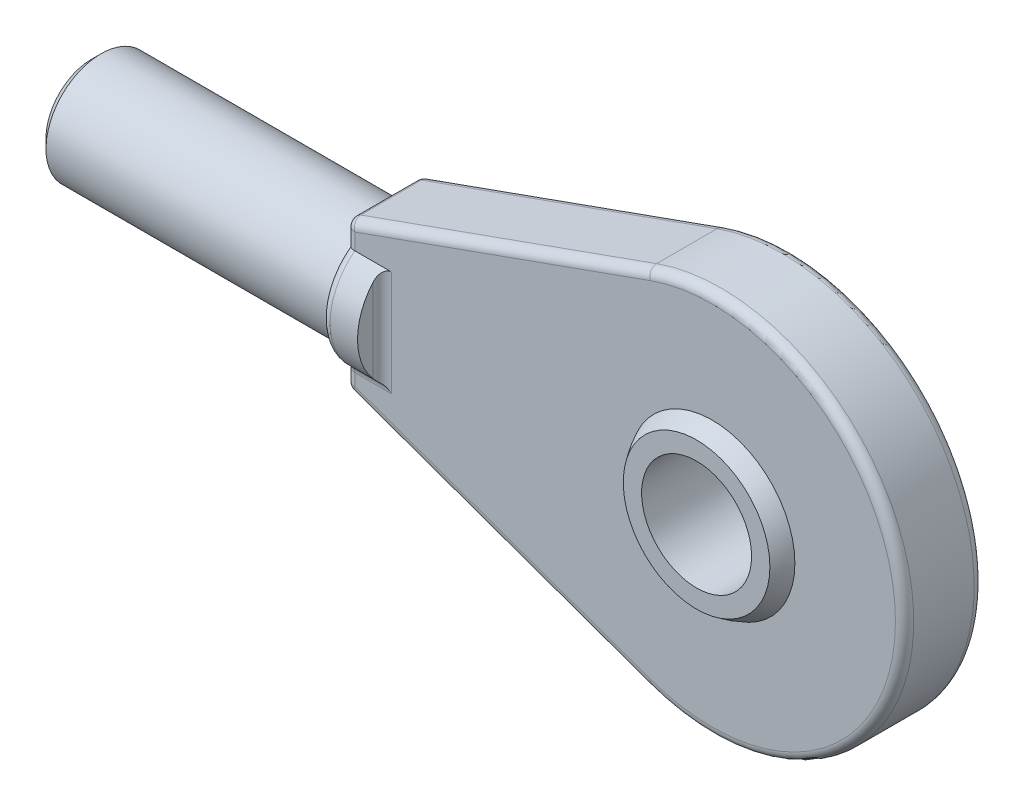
ISO-10303-21;
HEADER;
FILE_DESCRIPTION(('STEP AP214'),'2;1');
FILE_NAME('part.step','',(''),(''),'','','');
FILE_SCHEMA(('AUTOMOTIVE_DESIGN { 1 0 10303 214 1 1 1 1 }'));
ENDSEC;
DATA;
#1=APPLICATION_CONTEXT('core data for automotive mechanical design processes');
#2=APPLICATION_PROTOCOL_DEFINITION('international standard','automotive_design',2000,#1);
#3=PRODUCT_CONTEXT('',#1,'mechanical');
#4=PRODUCT('Part','Part','',(#3));
#5=PRODUCT_RELATED_PRODUCT_CATEGORY('part','',(#4));
#6=PRODUCT_DEFINITION_FORMATION('','',#4);
#7=PRODUCT_DEFINITION_CONTEXT('part definition',#1,'design');
#8=PRODUCT_DEFINITION('design','',#6,#7);
#9=PRODUCT_DEFINITION_SHAPE('','',#8);
#10=(LENGTH_UNIT() NAMED_UNIT(*) SI_UNIT(.MILLI.,.METRE.));
#11=(NAMED_UNIT(*) PLANE_ANGLE_UNIT() SI_UNIT($,.RADIAN.));
#12=(NAMED_UNIT(*) SI_UNIT($,.STERADIAN.) SOLID_ANGLE_UNIT());
#13=UNCERTAINTY_MEASURE_WITH_UNIT(LENGTH_MEASURE(1.E-05),#10,'distance_accuracy_value','');
#14=(GEOMETRIC_REPRESENTATION_CONTEXT(3) GLOBAL_UNCERTAINTY_ASSIGNED_CONTEXT((#13)) GLOBAL_UNIT_ASSIGNED_CONTEXT((#10,
#11,#12)) REPRESENTATION_CONTEXT('',''));
#15=CARTESIAN_POINT('',(0.,0.,0.));
#16=DIRECTION('',(0.,0.,1.));
#17=DIRECTION('',(1.,0.,0.));
#18=AXIS2_PLACEMENT_3D('',#15,#16,#17);
#19=CARTESIAN_POINT('',(16.,0.,0.));
#20=DIRECTION('',(1.,0.,0.));
#21=DIRECTION('',(0.,0.,-1.));
#22=AXIS2_PLACEMENT_3D('',#19,#20,#21);
#23=PLANE('',#22);
#24=CARTESIAN_POINT('',(16.,-2.99624765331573,-2.65));
#25=DIRECTION('',(1.,0.,0.));
#26=DIRECTION('',(0.,0.,-1.));
#27=AXIS2_PLACEMENT_3D('',#24,#25,#26);
#28=CIRCLE('',#27,1.);
#29=CARTESIAN_POINT('',(16.,-2.99624765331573,-1.65));
#30=VERTEX_POINT('',#29);
#31=CARTESIAN_POINT('',(16.,-2.2471857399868,-1.9875));
#32=VERTEX_POINT('',#31);
#33=EDGE_CURVE('E702',#30,#32,#28,.F.);
#34=ORIENTED_EDGE('',*,*,#33,.F.);
#35=DIRECTION('',(0.,-1.,0.));
#36=VECTOR('',#35,1.);
#37=CARTESIAN_POINT('',(16.,0.,-1.65));
#38=LINE('',#37,#36);
#39=CARTESIAN_POINT('',(16.,-3.64777527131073,-1.65));
#40=VERTEX_POINT('',#39);
#41=EDGE_CURVE('E700',#30,#40,#38,.T.);
#42=ORIENTED_EDGE('',*,*,#41,.T.);
#43=DIRECTION('',(0.,0.,-1.));
#44=VECTOR('',#43,1.);
#45=CARTESIAN_POINT('',(16.,-3.64777527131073,0.));
#46=LINE('',#45,#44);
#47=CARTESIAN_POINT('',(16.,-3.64777527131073,1.65));
#48=VERTEX_POINT('',#47);
#49=EDGE_CURVE('E698',#40,#48,#46,.F.);
#50=ORIENTED_EDGE('',*,*,#49,.T.);
#51=DIRECTION('',(0.,-1.,0.));
#52=VECTOR('',#51,1.);
#53=CARTESIAN_POINT('',(16.,0.,1.65));
#54=LINE('',#53,#52);
#55=CARTESIAN_POINT('',(16.,-2.99624765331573,1.65));
#56=VERTEX_POINT('',#55);
#57=EDGE_CURVE('E696',#48,#56,#54,.F.);
#58=ORIENTED_EDGE('',*,*,#57,.T.);
#59=CARTESIAN_POINT('',(16.,-2.99624765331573,2.65));
#60=DIRECTION('',(1.,0.,0.));
#61=DIRECTION('',(0.,0.,-1.));
#62=AXIS2_PLACEMENT_3D('',#59,#60,#61);
#63=CIRCLE('',#62,1.);
#64=CARTESIAN_POINT('',(16.,-2.2471857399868,1.9875));
#65=VERTEX_POINT('',#64);
#66=EDGE_CURVE('E693',#65,#56,#63,.F.);
#67=ORIENTED_EDGE('',*,*,#66,.F.);
#68=CARTESIAN_POINT('',(16.,0.,0.));
#69=DIRECTION('',(1.,0.,0.));
#70=DIRECTION('',(0.,0.,-1.));
#71=AXIS2_PLACEMENT_3D('',#68,#69,#70);
#72=CIRCLE('',#71,3.);
#73=EDGE_CURVE('E796',#65,#32,#72,.T.);
#74=ORIENTED_EDGE('',*,*,#73,.T.);
#75=EDGE_LOOP('',(#34,#42,#50,#58,#67,#74));
#76=FACE_BOUND('',#75,.T.);
#77=ADVANCED_FACE('F368',(#76),#23,.F.);
#78=CARTESIAN_POINT('',(16.,2.99624765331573,-2.65));
#79=DIRECTION('',(1.,0.,0.));
#80=DIRECTION('',(0.,0.,-1.));
#81=AXIS2_PLACEMENT_3D('',#78,#79,#80);
#82=CIRCLE('',#81,1.);
#83=CARTESIAN_POINT('',(16.,2.2471857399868,-1.9875));
#84=VERTEX_POINT('',#83);
#85=CARTESIAN_POINT('',(16.,2.99624765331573,-1.65));
#86=VERTEX_POINT('',#85);
#87=EDGE_CURVE('E690',#84,#86,#82,.F.);
#88=ORIENTED_EDGE('',*,*,#87,.F.);
#89=CARTESIAN_POINT('',(16.,2.50549396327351,1.65));
#90=VERTEX_POINT('',#89);
#91=EDGE_CURVE('E661',#84,#90,#72,.T.);
#92=ORIENTED_EDGE('',*,*,#91,.T.);
#93=DIRECTION('',(0.,-1.,0.));
#94=VECTOR('',#93,1.);
#95=CARTESIAN_POINT('',(16.,0.,1.65));
#96=LINE('',#95,#94);
#97=CARTESIAN_POINT('',(16.,3.64777527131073,1.65));
#98=VERTEX_POINT('',#97);
#99=EDGE_CURVE('E684',#90,#98,#96,.F.);
#100=ORIENTED_EDGE('',*,*,#99,.T.);
#101=DIRECTION('',(0.,0.,-1.));
#102=VECTOR('',#101,1.);
#103=CARTESIAN_POINT('',(16.,3.64777527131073,0.));
#104=LINE('',#103,#102);
#105=CARTESIAN_POINT('',(16.,3.64777527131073,-1.65));
#106=VERTEX_POINT('',#105);
#107=EDGE_CURVE('E686',#98,#106,#104,.T.);
#108=ORIENTED_EDGE('',*,*,#107,.T.);
#109=DIRECTION('',(0.,-1.,0.));
#110=VECTOR('',#109,1.);
#111=CARTESIAN_POINT('',(16.,0.,-1.65));
#112=LINE('',#111,#110);
#113=EDGE_CURVE('E688',#106,#86,#112,.T.);
#114=ORIENTED_EDGE('',*,*,#113,.T.);
#115=EDGE_LOOP('',(#88,#92,#100,#108,#114));
#116=FACE_BOUND('',#115,.T.);
#117=ADVANCED_FACE('F779',(#116),#23,.F.);
#118=CARTESIAN_POINT('',(36.,0.,0.));
#119=DIRECTION('',(0.,0.,1.));
#120=DIRECTION('',(1.,0.,0.));
#121=AXIS2_PLACEMENT_3D('',#118,#119,#120);
#122=SPHERICAL_SURFACE('',#121,5.);
#123=CARTESIAN_POINT('',(36.,0.,2.15));
#124=DIRECTION('',(0.,0.,-1.));
#125=DIRECTION('',(-1.,0.,0.));
#126=AXIS2_PLACEMENT_3D('',#123,#124,#125);
#127=CIRCLE('',#126,4.51414443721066);
#128=CARTESIAN_POINT('',(40.5141444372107,0.,2.15));
#129=VERTEX_POINT('',#128);
#130=EDGE_CURVE('E542',#129,#129,#127,.F.);
#131=CARTESIAN_POINT('',(36.,0.,3.));
#132=DIRECTION('',(0.,0.,1.));
#133=DIRECTION('',(1.,0.,0.));
#134=AXIS2_PLACEMENT_3D('',#131,#132,#133);
#135=CIRCLE('',#134,4.);
#136=CARTESIAN_POINT('',(40.,0.,3.));
#137=VERTEX_POINT('',#136);
#138=EDGE_CURVE('E664',#137,#137,#135,.T.);
#139=CARTESIAN_POINT('',(40.5141444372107,0.,2.15));
#140=CARTESIAN_POINT('',(40.5096874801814,0.,2.15935783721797));
#141=CARTESIAN_POINT('',(40.5052014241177,0.,2.16870181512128));
#142=CARTESIAN_POINT('',(40.4961712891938,0.,2.18736169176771));
#143=CARTESIAN_POINT('',(40.4916272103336,0.,2.19667759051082));
#144=CARTESIAN_POINT('',(40.4824812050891,0.,2.21528094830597));
#145=CARTESIAN_POINT('',(40.4778792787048,0.,2.22456840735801));
#146=CARTESIAN_POINT('',(40.4686177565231,0.,2.24311452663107));
#147=CARTESIAN_POINT('',(40.4639581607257,0.,2.25237318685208));
#148=CARTESIAN_POINT('',(40.4545814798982,0.,2.270861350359));
#149=CARTESIAN_POINT('',(40.4498643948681,0.,2.28009085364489));
#150=CARTESIAN_POINT('',(40.4403729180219,0.,2.29852034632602));
#151=CARTESIAN_POINT('',(40.4355985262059,0.,2.30772033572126));
#152=CARTESIAN_POINT('',(40.4259926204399,0.,2.32609044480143));
#153=CARTESIAN_POINT('',(40.4211611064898,0.,2.33526056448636));
#154=CARTESIAN_POINT('',(40.4114411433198,0.,2.35357057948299));
#155=CARTESIAN_POINT('',(40.4065526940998,0.,2.36271047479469));
#156=CARTESIAN_POINT('',(40.3967190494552,0.,2.38095968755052));
#157=CARTESIAN_POINT('',(40.3917738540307,0.,2.39006900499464));
#158=CARTESIAN_POINT('',(40.3818269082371,0.,2.40825670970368));
#159=CARTESIAN_POINT('',(40.3768251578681,0.,2.41733509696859));
#160=CARTESIAN_POINT('',(40.3667652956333,0.,2.43546059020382));
#161=CARTESIAN_POINT('',(40.3617071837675,0.,2.44450769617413));
#162=CARTESIAN_POINT('',(40.3515347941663,0.,2.4625702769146));
#163=CARTESIAN_POINT('',(40.346420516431,0.,2.47158575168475));
#164=CARTESIAN_POINT('',(40.3361359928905,0.,2.48958472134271));
#165=CARTESIAN_POINT('',(40.3309657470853,0.,2.49856821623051));
#166=CARTESIAN_POINT('',(40.3205694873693,0.,2.51650287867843));
#167=CARTESIAN_POINT('',(40.3153434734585,0.,2.52545404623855));
#168=CARTESIAN_POINT('',(40.3048358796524,0.,2.54332370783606));
#169=CARTESIAN_POINT('',(40.2995542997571,0.,2.55224220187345));
#170=CARTESIAN_POINT('',(40.2889357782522,0.,2.57004617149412));
#171=CARTESIAN_POINT('',(40.2835988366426,0.,2.57893164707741));
#172=CARTESIAN_POINT('',(40.2728697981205,0.,2.59666923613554));
#173=CARTESIAN_POINT('',(40.267477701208,0.,2.60552134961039));
#174=CARTESIAN_POINT('',(40.2566385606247,0.,2.6231918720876));
#175=CARTESIAN_POINT('',(40.2511915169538,0.,2.63201028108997));
#176=CARTESIAN_POINT('',(40.2402426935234,0.,2.64961305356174));
#177=CARTESIAN_POINT('',(40.2347409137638,0.,2.65839741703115));
#178=CARTESIAN_POINT('',(40.2236828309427,0.,2.67593175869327));
#179=CARTESIAN_POINT('',(40.2181265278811,0.,2.68468173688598));
#180=CARTESIAN_POINT('',(40.2069596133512,0.,2.70214696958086));
#181=CARTESIAN_POINT('',(40.201349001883,0.,2.71086222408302));
#182=CARTESIAN_POINT('',(40.1900736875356,0.,2.72825767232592));
#183=CARTESIAN_POINT('',(40.1844089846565,0.,2.73693786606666));
#184=CARTESIAN_POINT('',(40.1730257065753,0.,2.75426285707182));
#185=CARTESIAN_POINT('',(40.1673071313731,0.,2.76290765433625));
#186=CARTESIAN_POINT('',(40.1558163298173,0.,2.78016151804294));
#187=CARTESIAN_POINT('',(40.1500441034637,0.,2.78877058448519));
#188=CARTESIAN_POINT('',(40.1384462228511,0.,2.80595265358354));
#189=CARTESIAN_POINT('',(40.1326205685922,0.,2.81452565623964));
#190=CARTESIAN_POINT('',(40.1209160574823,0.,2.83163526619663));
#191=CARTESIAN_POINT('',(40.1150372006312,0.,2.84017187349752));
#192=CARTESIAN_POINT('',(40.1032265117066,0.,2.85720836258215));
#193=CARTESIAN_POINT('',(40.0972946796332,0.,2.86570824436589));
#194=CARTESIAN_POINT('',(40.0853782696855,0.,2.88267095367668));
#195=CARTESIAN_POINT('',(40.0793936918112,0.,2.89113378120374));
#196=CARTESIAN_POINT('',(40.067372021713,0.,2.90802205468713));
#197=CARTESIAN_POINT('',(40.061334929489,0.,2.91644750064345));
#198=CARTESIAN_POINT('',(40.0492084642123,0.,2.93326068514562));
#199=CARTESIAN_POINT('',(40.0431190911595,0.,2.94164842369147));
#200=CARTESIAN_POINT('',(40.0308882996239,0.,2.9583858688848));
#201=CARTESIAN_POINT('',(40.0247468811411,0.,2.96673557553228));
#202=CARTESIAN_POINT('',(40.0124122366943,0.,2.9833966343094));
#203=CARTESIAN_POINT('',(40.0062190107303,0.,2.99170798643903));
#204=CARTESIAN_POINT('',(40.,0.,3.));
#205=B_SPLINE_CURVE_WITH_KNOTS('',3,(#139,#140,#141,#142,#143,#144,#145,#146,#147,#148,#149,
#150,#151,#152,#153,#154,#155,#156,#157,#158,#159,#160,#161,#162,#163,#164,#165,#166,#167,#168,
#169,#170,#171,#172,#173,#174,#175,#176,#177,#178,#179,#180,#181,#182,#183,#184,#185,#186,#187,
#188,#189,#190,#191,#192,#193,#194,#195,#196,#197,#198,#199,#200,#201,#202,#203,#204),
.UNSPECIFIED.,.F.,.F.,(4,2,2,2,2,2,2,2,2,2,2,2,2,2,2,2,2,2,2,2,2,2,2,2,2,2,2,2,2,2,2,2,4),(0.,
0.0310950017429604,0.0621900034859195,0.0932850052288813,0.124380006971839,0.155475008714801,
0.186570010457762,0.217665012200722,0.248760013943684,0.279855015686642,0.310950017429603,
0.342045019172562,0.373140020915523,0.404235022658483,0.435330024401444,0.466425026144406,
0.497520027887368,0.528615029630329,0.559710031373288,0.590805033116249,0.621900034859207,
0.652995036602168,0.68409003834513,0.715185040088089,0.746280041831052,0.777375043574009,
0.80847004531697,0.839565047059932,0.870660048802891,0.901755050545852,0.932850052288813,
0.963945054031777,0.995040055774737),.UNSPECIFIED.);
#206=EDGE_CURVE('BSEAM920',#129,#137,#205,.T.);
#207=ORIENTED_EDGE('',*,*,#130,.T.);
#208=ORIENTED_EDGE('',*,*,#138,.F.);
#209=ORIENTED_EDGE('',*,*,#206,.T.);
#210=ORIENTED_EDGE('',*,*,#206,.F.);
#211=EDGE_LOOP('',(#207,#209,#208,#210));
#212=FACE_BOUND('',#211,.T.);
#213=ADVANCED_FACE('F920',(#212),#122,.T.);
#214=CARTESIAN_POINT('',(18.,0.,0.));
#215=DIRECTION('',(-1.,0.,0.));
#216=DIRECTION('',(0.,0.,1.));
#217=AXIS2_PLACEMENT_3D('',#214,#215,#216);
#218=CYLINDRICAL_SURFACE('',#217,3.5);
#219=CARTESIAN_POINT('',(18.,0.,0.));
#220=DIRECTION('',(1.,0.,0.));
#221=DIRECTION('',(0.,0.,-1.));
#222=AXIS2_PLACEMENT_3D('',#219,#220,#221);
#223=CIRCLE('',#222,3.5);
#224=CARTESIAN_POINT('',(18.,-2.28637267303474,-2.65));
#225=VERTEX_POINT('',#224);
#226=CARTESIAN_POINT('',(18.,2.28637267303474,-2.65));
#227=VERTEX_POINT('',#226);
#228=EDGE_CURVE('E530',#225,#227,#223,.T.);
#229=ORIENTED_EDGE('',*,*,#228,.F.);
#230=CARTESIAN_POINT('',(18.,-2.28637267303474,-2.65));
#231=CARTESIAN_POINT('',(18.0000089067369,-2.30738013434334,-2.63187565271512));
#232=CARTESIAN_POINT('',(18.0009868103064,-2.32816197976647,-2.61350796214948));
#233=CARTESIAN_POINT('',(18.0050979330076,-2.36922362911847,-2.57634448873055));
#234=CARTESIAN_POINT('',(18.0082371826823,-2.38950186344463,-2.55754765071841));
#235=CARTESIAN_POINT('',(18.0209375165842,-2.44803888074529,-2.50198162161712));
#236=CARTESIAN_POINT('',(18.0337587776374,-2.48537550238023,-2.4648463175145));
#237=CARTESIAN_POINT('',(18.0610899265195,-2.53860612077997,-2.40959788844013));
#238=CARTESIAN_POINT('',(18.0717216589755,-2.55607178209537,-2.39104645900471));
#239=CARTESIAN_POINT('',(18.0961457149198,-2.58989347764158,-2.35437679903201));
#240=CARTESIAN_POINT('',(18.1099853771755,-2.60622758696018,-2.33627006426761));
#241=CARTESIAN_POINT('',(18.1254690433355,-2.62171669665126,-2.31875));
#242=B_SPLINE_CURVE_WITH_KNOTS('',3,(#230,#231,#232,#233,#234,#235,#236,#237,#238,#239,#240,
#241),.UNSPECIFIED.,.F.,.F.,(4,2,2,2,2,4),(0.,0.0831848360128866,0.16660271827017,
0.328042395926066,0.410690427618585,0.494645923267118),.UNSPECIFIED.);
#243=CARTESIAN_POINT('',(18.1254690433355,-2.62171669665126,-2.31875));
#244=VERTEX_POINT('',#243);
#245=EDGE_CURVE('E538',#225,#244,#242,.T.);
#246=ORIENTED_EDGE('',*,*,#245,.T.);
#247=DIRECTION('',(-1.,0.,0.));
#248=VECTOR('',#247,1.);
#249=CARTESIAN_POINT('',(18.,-2.62171669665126,-2.31875));
#250=LINE('',#249,#248);
#251=CARTESIAN_POINT('',(16.5,-2.62171669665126,-2.31875));
#252=VERTEX_POINT('',#251);
#253=EDGE_CURVE('E682',#244,#252,#250,.T.);
#254=ORIENTED_EDGE('',*,*,#253,.T.);
#255=CARTESIAN_POINT('',(16.5,0.,0.));
#256=DIRECTION('',(1.,0.,0.));
#257=DIRECTION('',(0.,0.,-1.));
#258=AXIS2_PLACEMENT_3D('',#255,#256,#257);
#259=CIRCLE('',#258,3.5);
#260=CARTESIAN_POINT('',(16.5,2.62171669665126,-2.31875));
#261=VERTEX_POINT('',#260);
#262=EDGE_CURVE('E680',#252,#261,#259,.T.);
#263=ORIENTED_EDGE('',*,*,#262,.T.);
#264=DIRECTION('',(-1.,0.,0.));
#265=VECTOR('',#264,1.);
#266=CARTESIAN_POINT('',(18.,2.62171669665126,-2.31875));
#267=LINE('',#266,#265);
#268=CARTESIAN_POINT('',(18.1254690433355,2.62171669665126,-2.31875));
#269=VERTEX_POINT('',#268);
#270=EDGE_CURVE('E396',#261,#269,#267,.F.);
#271=ORIENTED_EDGE('',*,*,#270,.T.);
#272=CARTESIAN_POINT('',(18.1254690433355,2.62171669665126,-2.31875));
#273=CARTESIAN_POINT('',(18.1016040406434,2.59783334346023,-2.34580636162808));
#274=CARTESIAN_POINT('',(18.0816625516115,2.57197870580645,-2.37414777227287));
#275=CARTESIAN_POINT('',(18.0491322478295,2.51788471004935,-2.43140048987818));
#276=CARTESIAN_POINT('',(18.0363911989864,2.48971039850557,-2.46028550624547));
#277=CARTESIAN_POINT('',(18.0174184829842,2.43325695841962,-2.5160984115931));
#278=CARTESIAN_POINT('',(18.0108237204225,2.40509894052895,-2.54303371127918));
#279=CARTESIAN_POINT('',(18.0020779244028,2.34690954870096,-2.5968511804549));
#280=CARTESIAN_POINT('',(18.0000231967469,2.31685124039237,-2.62372033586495));
#281=CARTESIAN_POINT('',(18.,2.28637267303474,-2.65));
#282=B_SPLINE_CURVE_WITH_KNOTS('',3,(#272,#273,#274,#275,#276,#277,#278,#279,#280,#281),
.UNSPECIFIED.,.F.,.F.,(4,2,2,2,4),(0.,0.129175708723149,0.25550701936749,0.373787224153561,
0.494553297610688),.UNSPECIFIED.);
#283=EDGE_CURVE('E540',#269,#227,#282,.T.);
#284=ORIENTED_EDGE('',*,*,#283,.T.);
#285=EDGE_LOOP('',(#229,#246,#254,#263,#271,#284));
#286=FACE_BOUND('',#285,.T.);
#287=ADVANCED_FACE('F537',(#286),#218,.T.);
#288=CARTESIAN_POINT('',(36.,0.,-3.));
#289=DIRECTION('',(0.,0.,1.));
#290=DIRECTION('',(1.,0.,0.));
#291=AXIS2_PLACEMENT_3D('',#288,#289,#290);
#292=CIRCLE('',#291,4.);
#293=CARTESIAN_POINT('',(40.,0.,-3.));
#294=VERTEX_POINT('',#293);
#295=EDGE_CURVE('E668',#294,#294,#292,.T.);
#296=CARTESIAN_POINT('',(36.,0.,-2.15));
#297=DIRECTION('',(0.,0.,1.));
#298=DIRECTION('',(1.,0.,0.));
#299=AXIS2_PLACEMENT_3D('',#296,#297,#298);
#300=CIRCLE('',#299,4.51414443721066);
#301=CARTESIAN_POINT('',(40.5141444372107,0.,-2.15));
#302=VERTEX_POINT('',#301);
#303=EDGE_CURVE('E654',#302,#302,#300,.F.);
#304=CARTESIAN_POINT('',(40.,0.,-3.));
#305=CARTESIAN_POINT('',(40.0062190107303,0.,-2.99170798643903));
#306=CARTESIAN_POINT('',(40.0124122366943,0.,-2.9833966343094));
#307=CARTESIAN_POINT('',(40.0247468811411,0.,-2.96673557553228));
#308=CARTESIAN_POINT('',(40.0308882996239,0.,-2.9583858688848));
#309=CARTESIAN_POINT('',(40.0431190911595,0.,-2.94164842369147));
#310=CARTESIAN_POINT('',(40.0492084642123,0.,-2.93326068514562));
#311=CARTESIAN_POINT('',(40.061334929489,0.,-2.91644750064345));
#312=CARTESIAN_POINT('',(40.067372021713,0.,-2.90802205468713));
#313=CARTESIAN_POINT('',(40.0793936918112,0.,-2.89113378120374));
#314=CARTESIAN_POINT('',(40.0853782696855,0.,-2.88267095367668));
#315=CARTESIAN_POINT('',(40.0972946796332,0.,-2.86570824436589));
#316=CARTESIAN_POINT('',(40.1032265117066,0.,-2.85720836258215));
#317=CARTESIAN_POINT('',(40.1150372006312,0.,-2.84017187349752));
#318=CARTESIAN_POINT('',(40.1209160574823,0.,-2.83163526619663));
#319=CARTESIAN_POINT('',(40.1326205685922,0.,-2.81452565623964));
#320=CARTESIAN_POINT('',(40.1384462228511,0.,-2.80595265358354));
#321=CARTESIAN_POINT('',(40.1500441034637,0.,-2.78877058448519));
#322=CARTESIAN_POINT('',(40.1558163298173,0.,-2.78016151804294));
#323=CARTESIAN_POINT('',(40.1673071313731,0.,-2.76290765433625));
#324=CARTESIAN_POINT('',(40.1730257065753,0.,-2.75426285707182));
#325=CARTESIAN_POINT('',(40.1844089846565,0.,-2.73693786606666));
#326=CARTESIAN_POINT('',(40.1900736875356,0.,-2.72825767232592));
#327=CARTESIAN_POINT('',(40.201349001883,0.,-2.71086222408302));
#328=CARTESIAN_POINT('',(40.2069596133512,0.,-2.70214696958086));
#329=CARTESIAN_POINT('',(40.2181265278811,0.,-2.68468173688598));
#330=CARTESIAN_POINT('',(40.2236828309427,0.,-2.67593175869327));
#331=CARTESIAN_POINT('',(40.2347409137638,0.,-2.65839741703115));
#332=CARTESIAN_POINT('',(40.2402426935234,0.,-2.64961305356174));
#333=CARTESIAN_POINT('',(40.2511915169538,0.,-2.63201028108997));
#334=CARTESIAN_POINT('',(40.2566385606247,0.,-2.6231918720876));
#335=CARTESIAN_POINT('',(40.267477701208,0.,-2.60552134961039));
#336=CARTESIAN_POINT('',(40.2728697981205,0.,-2.59666923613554));
#337=CARTESIAN_POINT('',(40.2835988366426,0.,-2.57893164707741));
#338=CARTESIAN_POINT('',(40.2889357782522,0.,-2.57004617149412));
#339=CARTESIAN_POINT('',(40.2995542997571,0.,-2.55224220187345));
#340=CARTESIAN_POINT('',(40.3048358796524,0.,-2.54332370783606));
#341=CARTESIAN_POINT('',(40.3153434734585,0.,-2.52545404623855));
#342=CARTESIAN_POINT('',(40.3205694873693,0.,-2.51650287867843));
#343=CARTESIAN_POINT('',(40.3309657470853,0.,-2.49856821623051));
#344=CARTESIAN_POINT('',(40.3361359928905,0.,-2.48958472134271));
#345=CARTESIAN_POINT('',(40.346420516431,0.,-2.47158575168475));
#346=CARTESIAN_POINT('',(40.3515347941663,0.,-2.4625702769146));
#347=CARTESIAN_POINT('',(40.3617071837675,0.,-2.44450769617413));
#348=CARTESIAN_POINT('',(40.3667652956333,0.,-2.43546059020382));
#349=CARTESIAN_POINT('',(40.3768251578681,0.,-2.41733509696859));
#350=CARTESIAN_POINT('',(40.3818269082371,0.,-2.40825670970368));
#351=CARTESIAN_POINT('',(40.3917738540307,0.,-2.39006900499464));
#352=CARTESIAN_POINT('',(40.3967190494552,0.,-2.38095968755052));
#353=CARTESIAN_POINT('',(40.4065526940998,0.,-2.36271047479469));
#354=CARTESIAN_POINT('',(40.4114411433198,0.,-2.35357057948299));
#355=CARTESIAN_POINT('',(40.4211611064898,0.,-2.33526056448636));
#356=CARTESIAN_POINT('',(40.4259926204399,0.,-2.32609044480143));
#357=CARTESIAN_POINT('',(40.4355985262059,0.,-2.30772033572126));
#358=CARTESIAN_POINT('',(40.4403729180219,0.,-2.29852034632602));
#359=CARTESIAN_POINT('',(40.4498643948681,0.,-2.28009085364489));
#360=CARTESIAN_POINT('',(40.4545814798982,0.,-2.270861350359));
#361=CARTESIAN_POINT('',(40.4639581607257,0.,-2.25237318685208));
#362=CARTESIAN_POINT('',(40.4686177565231,0.,-2.24311452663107));
#363=CARTESIAN_POINT('',(40.4778792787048,0.,-2.22456840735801));
#364=CARTESIAN_POINT('',(40.4824812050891,0.,-2.21528094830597));
#365=CARTESIAN_POINT('',(40.4916272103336,0.,-2.19667759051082));
#366=CARTESIAN_POINT('',(40.4961712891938,0.,-2.18736169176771));
#367=CARTESIAN_POINT('',(40.5052014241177,0.,-2.16870181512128));
#368=CARTESIAN_POINT('',(40.5096874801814,0.,-2.15935783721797));
#369=CARTESIAN_POINT('',(40.5141444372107,0.,-2.15));
#370=B_SPLINE_CURVE_WITH_KNOTS('',3,(#304,#305,#306,#307,#308,#309,#310,#311,#312,#313,#314,
#315,#316,#317,#318,#319,#320,#321,#322,#323,#324,#325,#326,#327,#328,#329,#330,#331,#332,#333,
#334,#335,#336,#337,#338,#339,#340,#341,#342,#343,#344,#345,#346,#347,#348,#349,#350,#351,#352,
#353,#354,#355,#356,#357,#358,#359,#360,#361,#362,#363,#364,#365,#366,#367,#368,#369),
.UNSPECIFIED.,.F.,.F.,(4,2,2,2,2,2,2,2,2,2,2,2,2,2,2,2,2,2,2,2,2,2,2,2,2,2,2,2,2,2,2,2,4),(0.,
0.0310950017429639,0.062190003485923,0.0932850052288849,0.124380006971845,0.155475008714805,
0.186570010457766,0.217665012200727,0.248760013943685,0.279855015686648,0.310950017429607,
0.342045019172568,0.373140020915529,0.404235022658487,0.435330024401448,0.466425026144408,
0.497520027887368,0.528615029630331,0.559710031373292,0.590805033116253,0.621900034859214,
0.652995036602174,0.684090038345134,0.715185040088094,0.746280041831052,0.777375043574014,
0.808470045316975,0.839565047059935,0.870660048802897,0.901755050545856,0.932850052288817,
0.963945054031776,0.995040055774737),.UNSPECIFIED.);
#371=EDGE_CURVE('BSEAM916',#294,#302,#370,.T.);
#372=ORIENTED_EDGE('',*,*,#295,.T.);
#373=ORIENTED_EDGE('',*,*,#303,.T.);
#374=ORIENTED_EDGE('',*,*,#371,.T.);
#375=ORIENTED_EDGE('',*,*,#371,.F.);
#376=EDGE_LOOP('',(#372,#374,#373,#375));
#377=FACE_BOUND('',#376,.T.);
#378=ADVANCED_FACE('F916',(#377),#122,.T.);
#379=CARTESIAN_POINT('',(32.,3.,2.15));
#380=DIRECTION('',(0.,0.,-1.));
#381=DIRECTION('',(-1.,0.,0.));
#382=AXIS2_PLACEMENT_3D('',#379,#380,#381);
#383=PLANE('',#382);
#384=ORIENTED_EDGE('',*,*,#130,.F.);
#385=EDGE_LOOP('',(#384));
#386=FACE_BOUND('',#385,.T.);
#387=DIRECTION('',(-0.94162059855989,-0.336675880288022,0.));
#388=VECTOR('',#387,1.);
#389=CARTESIAN_POINT('',(30.0377066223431,8.4881741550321,2.15));
#390=LINE('',#389,#388);
#391=CARTESIAN_POINT('',(32.6332411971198,9.4162059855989,2.15));
#392=VERTEX_POINT('',#391);
#393=CARTESIAN_POINT('',(16.5,3.64777527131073,2.15));
#394=VERTEX_POINT('',#393);
#395=EDGE_CURVE('E750',#392,#394,#390,.T.);
#396=ORIENTED_EDGE('',*,*,#395,.T.);
#397=DIRECTION('',(0.,-1.,0.));
#398=VECTOR('',#397,1.);
#399=CARTESIAN_POINT('',(16.5,3.,2.15));
#400=LINE('',#399,#398);
#401=CARTESIAN_POINT('',(16.5,2.7617928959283,2.15));
#402=VERTEX_POINT('',#401);
#403=EDGE_CURVE('E752',#394,#402,#400,.T.);
#404=ORIENTED_EDGE('',*,*,#403,.T.);
#405=DIRECTION('',(-1.,0.,0.));
#406=VECTOR('',#405,1.);
#407=CARTESIAN_POINT('',(18.,2.7617928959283,2.15));
#408=LINE('',#407,#406);
#409=CARTESIAN_POINT('',(18.5,2.7617928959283,2.15));
#410=VERTEX_POINT('',#409);
#411=EDGE_CURVE('E651',#410,#402,#408,.T.);
#412=ORIENTED_EDGE('',*,*,#411,.F.);
#413=DIRECTION('',(0.,-1.,0.));
#414=VECTOR('',#413,1.);
#415=CARTESIAN_POINT('',(18.5,3.,2.15));
#416=LINE('',#415,#414);
#417=CARTESIAN_POINT('',(18.5,-2.99624765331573,2.15));
#418=VERTEX_POINT('',#417);
#419=EDGE_CURVE('E533',#410,#418,#416,.T.);
#420=ORIENTED_EDGE('',*,*,#419,.T.);
#421=DIRECTION('',(1.,0.,0.));
#422=VECTOR('',#421,1.);
#423=CARTESIAN_POINT('',(18.,-2.99624765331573,2.15));
#424=LINE('',#423,#422);
#425=CARTESIAN_POINT('',(16.5,-2.99624765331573,2.15));
#426=VERTEX_POINT('',#425);
#427=EDGE_CURVE('E742',#418,#426,#424,.F.);
#428=ORIENTED_EDGE('',*,*,#427,.T.);
#429=DIRECTION('',(0.,-1.,0.));
#430=VECTOR('',#429,1.);
#431=CARTESIAN_POINT('',(16.5,3.,2.15));
#432=LINE('',#431,#430);
#433=CARTESIAN_POINT('',(16.5,-3.64777527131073,2.15));
#434=VERTEX_POINT('',#433);
#435=EDGE_CURVE('E744',#426,#434,#432,.T.);
#436=ORIENTED_EDGE('',*,*,#435,.T.);
#437=DIRECTION('',(0.94162059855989,-0.336675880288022,0.));
#438=VECTOR('',#437,1.);
#439=CARTESIAN_POINT('',(28.1355809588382,-7.80807026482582,2.15));
#440=LINE('',#439,#438);
#441=CARTESIAN_POINT('',(32.6332411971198,-9.4162059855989,2.15));
#442=VERTEX_POINT('',#441);
#443=EDGE_CURVE('E746',#434,#442,#440,.T.);
#444=ORIENTED_EDGE('',*,*,#443,.T.);
#445=CARTESIAN_POINT('',(36.,0.,2.15));
#446=DIRECTION('',(0.,0.,-1.));
#447=DIRECTION('',(-1.,0.,0.));
#448=AXIS2_PLACEMENT_3D('',#445,#446,#447);
#449=CIRCLE('',#448,10.);
#450=EDGE_CURVE('E748',#442,#392,#449,.F.);
#451=ORIENTED_EDGE('',*,*,#450,.T.);
#452=EDGE_LOOP('',(#396,#404,#412,#420,#428,#436,#444,#451));
#453=FACE_BOUND('',#452,.T.);
#454=ADVANCED_FACE('F764',(#386,#453),#383,.F.);
#455=CARTESIAN_POINT('',(32.,-3.,-2.15));
#456=DIRECTION('',(0.,0.,1.));
#457=DIRECTION('',(1.,0.,0.));
#458=AXIS2_PLACEMENT_3D('',#455,#456,#457);
#459=PLANE('',#458);
#460=CARTESIAN_POINT('',(36.,0.,-2.15));
#461=DIRECTION('',(0.,0.,1.));
#462=DIRECTION('',(1.,0.,0.));
#463=AXIS2_PLACEMENT_3D('',#460,#461,#462);
#464=CIRCLE('',#463,10.);
#465=CARTESIAN_POINT('',(32.6332411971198,9.4162059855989,-2.15));
#466=VERTEX_POINT('',#465);
#467=CARTESIAN_POINT('',(32.6332411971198,-9.4162059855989,-2.15));
#468=VERTEX_POINT('',#467);
#469=EDGE_CURVE('E728',#466,#468,#464,.F.);
#470=ORIENTED_EDGE('',*,*,#469,.T.);
#471=DIRECTION('',(0.94162059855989,-0.336675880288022,0.));
#472=VECTOR('',#471,1.);
#473=CARTESIAN_POINT('',(30.0377066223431,-8.4881741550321,-2.15));
#474=LINE('',#473,#472);
#475=CARTESIAN_POINT('',(16.5,-3.64777527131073,-2.15));
#476=VERTEX_POINT('',#475);
#477=EDGE_CURVE('E730',#468,#476,#474,.F.);
#478=ORIENTED_EDGE('',*,*,#477,.T.);
#479=DIRECTION('',(0.,-1.,0.));
#480=VECTOR('',#479,1.);
#481=CARTESIAN_POINT('',(16.5,-3.,-2.15));
#482=LINE('',#481,#480);
#483=CARTESIAN_POINT('',(16.5,-2.99624765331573,-2.15));
#484=VERTEX_POINT('',#483);
#485=EDGE_CURVE('E726',#476,#484,#482,.F.);
#486=ORIENTED_EDGE('',*,*,#485,.T.);
#487=DIRECTION('',(1.,0.,0.));
#488=VECTOR('',#487,1.);
#489=CARTESIAN_POINT('',(18.,-2.99624765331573,-2.15));
#490=LINE('',#489,#488);
#491=CARTESIAN_POINT('',(18.5,-2.99624765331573,-2.15));
#492=VERTEX_POINT('',#491);
#493=EDGE_CURVE('E724',#484,#492,#490,.T.);
#494=ORIENTED_EDGE('',*,*,#493,.T.);
#495=DIRECTION('',(0.,1.,0.));
#496=VECTOR('',#495,1.);
#497=CARTESIAN_POINT('',(18.5,-3.,-2.15));
#498=LINE('',#497,#496);
#499=CARTESIAN_POINT('',(18.5,2.99624765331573,-2.15));
#500=VERTEX_POINT('',#499);
#501=EDGE_CURVE('E722',#492,#500,#498,.T.);
#502=ORIENTED_EDGE('',*,*,#501,.T.);
#503=DIRECTION('',(1.,0.,0.));
#504=VECTOR('',#503,1.);
#505=CARTESIAN_POINT('',(18.,2.99624765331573,-2.15));
#506=LINE('',#505,#504);
#507=CARTESIAN_POINT('',(16.5,2.99624765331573,-2.15));
#508=VERTEX_POINT('',#507);
#509=EDGE_CURVE('E717',#500,#508,#506,.F.);
#510=ORIENTED_EDGE('',*,*,#509,.T.);
#511=DIRECTION('',(0.,-1.,0.));
#512=VECTOR('',#511,1.);
#513=CARTESIAN_POINT('',(16.5,-3.,-2.15));
#514=LINE('',#513,#512);
#515=CARTESIAN_POINT('',(16.5,3.64777527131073,-2.15));
#516=VERTEX_POINT('',#515);
#517=EDGE_CURVE('E715',#508,#516,#514,.F.);
#518=ORIENTED_EDGE('',*,*,#517,.T.);
#519=DIRECTION('',(-0.94162059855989,-0.336675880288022,0.));
#520=VECTOR('',#519,1.);
#521=CARTESIAN_POINT('',(28.1355809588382,7.80807026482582,-2.15));
#522=LINE('',#521,#520);
#523=EDGE_CURVE('E719',#516,#466,#522,.F.);
#524=ORIENTED_EDGE('',*,*,#523,.T.);
#525=EDGE_LOOP('',(#470,#478,#486,#494,#502,#510,#518,#524));
#526=FACE_BOUND('',#525,.T.);
#527=ORIENTED_EDGE('',*,*,#303,.F.);
#528=EDGE_LOOP('',(#527));
#529=FACE_BOUND('',#528,.T.);
#530=ADVANCED_FACE('F910',(#526,#529),#459,.F.);
#531=CARTESIAN_POINT('',(18.,0.,0.));
#532=DIRECTION('',(1.,0.,0.));
#533=DIRECTION('',(0.,0.,-1.));
#534=AXIS2_PLACEMENT_3D('',#531,#532,#533);
#535=PLANE('',#534);
#536=CARTESIAN_POINT('',(18.,2.28637267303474,2.65));
#537=VERTEX_POINT('',#536);
#538=CARTESIAN_POINT('',(18.,-2.28637267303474,2.65));
#539=VERTEX_POINT('',#538);
#540=EDGE_CURVE('E541',#537,#539,#223,.T.);
#541=ORIENTED_EDGE('',*,*,#540,.T.);
#542=DIRECTION('',(0.,-1.,0.));
#543=VECTOR('',#542,1.);
#544=CARTESIAN_POINT('',(18.,0.,2.65));
#545=LINE('',#544,#543);
#546=EDGE_CURVE('E550',#539,#537,#545,.F.);
#547=ORIENTED_EDGE('',*,*,#546,.T.);
#548=EDGE_LOOP('',(#541,#547));
#549=FACE_BOUND('',#548,.T.);
#550=ADVANCED_FACE('F756',(#549),#535,.T.);
#551=CARTESIAN_POINT('',(16.,0.,0.));
#552=DIRECTION('',(-1.,0.,0.));
#553=DIRECTION('',(0.,0.,1.));
#554=AXIS2_PLACEMENT_3D('',#551,#552,#553);
#555=CYLINDRICAL_SURFACE('',#554,3.);
#556=CARTESIAN_POINT('',(0.500000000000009,0.,0.));
#557=DIRECTION('',(1.,0.,0.));
#558=DIRECTION('',(0.,0.,-1.));
#559=AXIS2_PLACEMENT_3D('',#556,#557,#558);
#560=CIRCLE('',#559,3.);
#561=CARTESIAN_POINT('',(0.500000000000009,0.,-3.));
#562=VERTEX_POINT('',#561);
#563=EDGE_CURVE('E671',#562,#562,#560,.T.);
#564=ORIENTED_EDGE('',*,*,#563,.T.);
#565=EDGE_LOOP('',(#564));
#566=FACE_BOUND('',#565,.T.);
#567=ORIENTED_EDGE('',*,*,#91,.F.);
#568=EDGE_CURVE('E660',#32,#84,#72,.T.);
#569=ORIENTED_EDGE('',*,*,#568,.F.);
#570=ORIENTED_EDGE('',*,*,#73,.F.);
#571=EDGE_CURVE('E665',#90,#65,#72,.T.);
#572=ORIENTED_EDGE('',*,*,#571,.F.);
#573=EDGE_LOOP('',(#567,#569,#570,#572));
#574=FACE_BOUND('',#573,.T.);
#575=ADVANCED_FACE('F370',(#566,#574),#555,.T.);
#576=CARTESIAN_POINT('',(0.,0.,0.));
#577=DIRECTION('',(1.,0.,0.));
#578=DIRECTION('',(0.,0.,-1.));
#579=AXIS2_PLACEMENT_3D('',#576,#577,#578);
#580=PLANE('',#579);
#581=CARTESIAN_POINT('',(0.,0.,0.));
#582=DIRECTION('',(1.,0.,0.));
#583=DIRECTION('',(0.,0.,-1.));
#584=AXIS2_PLACEMENT_3D('',#581,#582,#583);
#585=CIRCLE('',#584,2.5);
#586=CARTESIAN_POINT('',(0.,0.,-2.5));
#587=VERTEX_POINT('',#586);
#588=EDGE_CURVE('E674',#587,#587,#585,.F.);
#589=ORIENTED_EDGE('',*,*,#588,.T.);
#590=EDGE_LOOP('',(#589));
#591=FACE_BOUND('',#590,.T.);
#592=ADVANCED_FACE('F936',(#591),#580,.F.);
#593=ORIENTED_EDGE('',*,*,#411,.T.);
#594=CARTESIAN_POINT('',(16.5,0.,0.));
#595=DIRECTION('',(1.,0.,0.));
#596=DIRECTION('',(0.,0.,-1.));
#597=AXIS2_PLACEMENT_3D('',#594,#595,#596);
#598=CIRCLE('',#597,3.5);
#599=CARTESIAN_POINT('',(16.5,-2.62171669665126,2.31875));
#600=VERTEX_POINT('',#599);
#601=EDGE_CURVE('E706',#402,#600,#598,.T.);
#602=ORIENTED_EDGE('',*,*,#601,.T.);
#603=DIRECTION('',(-1.,0.,0.));
#604=VECTOR('',#603,1.);
#605=CARTESIAN_POINT('',(18.,-2.62171669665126,2.31875));
#606=LINE('',#605,#604);
#607=CARTESIAN_POINT('',(18.1254690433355,-2.62171669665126,2.31875));
#608=VERTEX_POINT('',#607);
#609=EDGE_CURVE('E388',#600,#608,#606,.F.);
#610=ORIENTED_EDGE('',*,*,#609,.T.);
#611=CARTESIAN_POINT('',(18.1254690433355,-2.62171669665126,2.31875));
#612=CARTESIAN_POINT('',(18.1016040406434,-2.59783334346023,2.34580636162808));
#613=CARTESIAN_POINT('',(18.0816625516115,-2.57197870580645,2.37414777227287));
#614=CARTESIAN_POINT('',(18.0491322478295,-2.51788471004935,2.43140048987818));
#615=CARTESIAN_POINT('',(18.0363911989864,-2.48971039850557,2.46028550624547));
#616=CARTESIAN_POINT('',(18.0174184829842,-2.43325695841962,2.5160984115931));
#617=CARTESIAN_POINT('',(18.0108237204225,-2.40509894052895,2.54303371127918));
#618=CARTESIAN_POINT('',(18.0020779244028,-2.34690954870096,2.5968511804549));
#619=CARTESIAN_POINT('',(18.0000231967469,-2.31685124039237,2.62372033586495));
#620=CARTESIAN_POINT('',(18.,-2.28637267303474,2.65));
#621=B_SPLINE_CURVE_WITH_KNOTS('',3,(#611,#612,#613,#614,#615,#616,#617,#618,#619,#620),
.UNSPECIFIED.,.F.,.F.,(4,2,2,2,4),(0.,0.129175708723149,0.25550701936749,0.373787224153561,
0.494553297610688),.UNSPECIFIED.);
#622=EDGE_CURVE('E381',#608,#539,#621,.T.);
#623=ORIENTED_EDGE('',*,*,#622,.T.);
#624=ORIENTED_EDGE('',*,*,#540,.F.);
#625=CARTESIAN_POINT('',(18.,2.28637267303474,2.65));
#626=CARTESIAN_POINT('',(18.0000083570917,2.30693907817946,2.63225564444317));
#627=CARTESIAN_POINT('',(18.0009457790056,2.32728836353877,2.61427969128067));
#628=CARTESIAN_POINT('',(18.0048823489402,2.36750980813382,2.57791350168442));
#629=CARTESIAN_POINT('',(18.0078872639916,2.38738047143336,2.55952224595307));
#630=CARTESIAN_POINT('',(18.0203841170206,2.44641985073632,2.50358939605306));
#631=CARTESIAN_POINT('',(18.0333663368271,2.48460908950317,2.46564011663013));
#632=CARTESIAN_POINT('',(18.0632953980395,2.54290283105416,2.40513933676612));
#633=CARTESIAN_POINT('',(18.0768676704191,2.56437023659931,2.38221012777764));
#634=CARTESIAN_POINT('',(18.1085983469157,2.60502952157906,2.33767400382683));
#635=CARTESIAN_POINT('',(18.1267367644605,2.62423079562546,2.31606182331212));
#636=CARTESIAN_POINT('',(18.1641945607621,2.65662602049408,2.27878014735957));
#637=CARTESIAN_POINT('',(18.1827378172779,2.67028183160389,2.26273562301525));
#638=CARTESIAN_POINT('',(18.2230543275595,2.69523632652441,2.23295285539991));
#639=CARTESIAN_POINT('',(18.2448293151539,2.70653373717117,2.21921585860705));
#640=CARTESIAN_POINT('',(18.2914784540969,2.72638187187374,2.19478776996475));
#641=CARTESIAN_POINT('',(18.3163788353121,2.73490685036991,2.18412532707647));
#642=CARTESIAN_POINT('',(18.3683916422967,2.74860786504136,2.16685919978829));
#643=CARTESIAN_POINT('',(18.3954986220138,2.75379188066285,2.16024584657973));
#644=CARTESIAN_POINT('',(18.4358014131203,2.75869737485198,2.15397171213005));
#645=CARTESIAN_POINT('',(18.4485703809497,2.75985663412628,2.15248545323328));
#646=CARTESIAN_POINT('',(18.4742231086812,2.76140419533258,2.1504994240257));
#647=CARTESIAN_POINT('',(18.4871067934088,2.76179296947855,2.14999904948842));
#648=CARTESIAN_POINT('',(18.5,2.7617928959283,2.15));
#649=B_SPLINE_CURVE_WITH_KNOTS('',3,(#625,#626,#627,#628,#629,#630,#631,#632,#633,#634,#635,
#636,#637,#638,#639,#640,#641,#642,#643,#644,#645,#646,#647,#648),.UNSPECIFIED.,.F.,.F.,(4,2,2,
2,2,2,2,2,2,2,2,4),(0.,0.081437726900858,0.163103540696,0.32803021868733,0.430363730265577,
0.532256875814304,0.616130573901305,0.700049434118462,0.784726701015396,0.869200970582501,
0.907870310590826,0.946515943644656),.UNSPECIFIED.);
#650=EDGE_CURVE('E11',#537,#410,#649,.T.);
#651=ORIENTED_EDGE('',*,*,#650,.T.);
#652=EDGE_LOOP('',(#593,#602,#610,#623,#624,#651));
#653=FACE_BOUND('',#652,.T.);
#654=ADVANCED_FACE('F563',(#653),#218,.T.);
#655=ORIENTED_EDGE('',*,*,#228,.T.);
#656=DIRECTION('',(0.,1.,0.));
#657=VECTOR('',#656,1.);
#658=CARTESIAN_POINT('',(18.,0.,-2.65));
#659=LINE('',#658,#657);
#660=EDGE_CURVE('E527',#227,#225,#659,.F.);
#661=ORIENTED_EDGE('',*,*,#660,.T.);
#662=EDGE_LOOP('',(#655,#661));
#663=FACE_BOUND('',#662,.T.);
#664=ADVANCED_FACE('F529',(#663),#535,.T.);
#665=CARTESIAN_POINT('',(16.,-4.,2.15));
#666=DIRECTION('',(0.336675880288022,0.94162059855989,0.));
#667=DIRECTION('',(-0.94162059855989,0.336675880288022,0.));
#668=AXIS2_PLACEMENT_3D('',#665,#666,#667);
#669=PLANE('',#668);
#670=DIRECTION('',(0.,0.,-1.));
#671=VECTOR('',#670,1.);
#672=CARTESIAN_POINT('',(16.331662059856,-4.11858557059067,2.15));
#673=LINE('',#672,#671);
#674=CARTESIAN_POINT('',(16.331662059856,-4.11858557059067,1.65));
#675=VERTEX_POINT('',#674);
#676=CARTESIAN_POINT('',(16.331662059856,-4.11858557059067,-1.65));
#677=VERTEX_POINT('',#676);
#678=EDGE_CURVE('E738',#675,#677,#673,.T.);
#679=ORIENTED_EDGE('',*,*,#678,.T.);
#680=DIRECTION('',(0.94162059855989,-0.336675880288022,0.));
#681=VECTOR('',#680,1.);
#682=CARTESIAN_POINT('',(16.,-4.,-1.65));
#683=LINE('',#682,#681);
#684=CARTESIAN_POINT('',(32.4649032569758,-9.88701628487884,-1.65));
#685=VERTEX_POINT('',#684);
#686=EDGE_CURVE('E534',#677,#685,#683,.T.);
#687=ORIENTED_EDGE('',*,*,#686,.T.);
#688=DIRECTION('',(0.,0.,-1.));
#689=VECTOR('',#688,1.);
#690=CARTESIAN_POINT('',(32.4649032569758,-9.88701628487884,2.15));
#691=LINE('',#690,#689);
#692=CARTESIAN_POINT('',(32.4649032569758,-9.88701628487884,1.65));
#693=VERTEX_POINT('',#692);
#694=EDGE_CURVE('E648',#693,#685,#691,.T.);
#695=ORIENTED_EDGE('',*,*,#694,.F.);
#696=DIRECTION('',(0.94162059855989,-0.336675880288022,0.));
#697=VECTOR('',#696,1.);
#698=CARTESIAN_POINT('',(16.,-4.,1.65));
#699=LINE('',#698,#697);
#700=EDGE_CURVE('E736',#693,#675,#699,.F.);
#701=ORIENTED_EDGE('',*,*,#700,.T.);
#702=EDGE_LOOP('',(#679,#687,#695,#701));
#703=FACE_BOUND('',#702,.T.);
#704=ADVANCED_FACE('F863',(#703),#669,.F.);
#705=CARTESIAN_POINT('',(36.,0.,2.15));
#706=DIRECTION('',(0.,0.,-1.));
#707=DIRECTION('',(-1.,0.,0.));
#708=AXIS2_PLACEMENT_3D('',#705,#706,#707);
#709=CYLINDRICAL_SURFACE('',#708,10.5);
#710=ORIENTED_EDGE('',*,*,#694,.T.);
#711=CARTESIAN_POINT('',(36.,0.,-1.65));
#712=DIRECTION('',(0.,0.,1.));
#713=DIRECTION('',(1.,0.,0.));
#714=AXIS2_PLACEMENT_3D('',#711,#712,#713);
#715=CIRCLE('',#714,10.5);
#716=CARTESIAN_POINT('',(32.4649032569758,9.88701628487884,-1.65));
#717=VERTEX_POINT('',#716);
#718=EDGE_CURVE('E734',#685,#717,#715,.T.);
#719=ORIENTED_EDGE('',*,*,#718,.T.);
#720=DIRECTION('',(0.,0.,-1.));
#721=VECTOR('',#720,1.);
#722=CARTESIAN_POINT('',(32.4649032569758,9.88701628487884,2.15));
#723=LINE('',#722,#721);
#724=CARTESIAN_POINT('',(32.4649032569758,9.88701628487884,1.65));
#725=VERTEX_POINT('',#724);
#726=EDGE_CURVE('E645',#725,#717,#723,.T.);
#727=ORIENTED_EDGE('',*,*,#726,.F.);
#728=CARTESIAN_POINT('',(36.,0.,1.65));
#729=DIRECTION('',(0.,0.,-1.));
#730=DIRECTION('',(-1.,0.,0.));
#731=AXIS2_PLACEMENT_3D('',#728,#729,#730);
#732=CIRCLE('',#731,10.5);
#733=EDGE_CURVE('E732',#725,#693,#732,.T.);
#734=ORIENTED_EDGE('',*,*,#733,.T.);
#735=EDGE_LOOP('',(#710,#719,#727,#734));
#736=FACE_BOUND('',#735,.T.);
#737=ADVANCED_FACE('F876',(#736),#709,.T.);
#738=CARTESIAN_POINT('',(32.4649032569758,9.88701628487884,2.15));
#739=DIRECTION('',(0.336675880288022,-0.94162059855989,0.));
#740=DIRECTION('',(0.94162059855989,0.336675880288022,0.));
#741=AXIS2_PLACEMENT_3D('',#738,#739,#740);
#742=PLANE('',#741);
#743=ORIENTED_EDGE('',*,*,#726,.T.);
#744=DIRECTION('',(-0.94162059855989,-0.336675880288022,0.));
#745=VECTOR('',#744,1.);
#746=CARTESIAN_POINT('',(32.4649032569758,9.88701628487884,-1.65));
#747=LINE('',#746,#745);
#748=CARTESIAN_POINT('',(16.331662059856,4.11858557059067,-1.65));
#749=VERTEX_POINT('',#748);
#750=EDGE_CURVE('E712',#717,#749,#747,.T.);
#751=ORIENTED_EDGE('',*,*,#750,.T.);
#752=DIRECTION('',(0.,0.,-1.));
#753=VECTOR('',#752,1.);
#754=CARTESIAN_POINT('',(16.331662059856,4.11858557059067,2.15));
#755=LINE('',#754,#753);
#756=CARTESIAN_POINT('',(16.331662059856,4.11858557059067,1.65));
#757=VERTEX_POINT('',#756);
#758=EDGE_CURVE('E710',#749,#757,#755,.F.);
#759=ORIENTED_EDGE('',*,*,#758,.T.);
#760=DIRECTION('',(-0.94162059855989,-0.336675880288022,0.));
#761=VECTOR('',#760,1.);
#762=CARTESIAN_POINT('',(32.4649032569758,9.88701628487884,1.65));
#763=LINE('',#762,#761);
#764=EDGE_CURVE('E708',#757,#725,#763,.F.);
#765=ORIENTED_EDGE('',*,*,#764,.T.);
#766=EDGE_LOOP('',(#743,#751,#759,#765));
#767=FACE_BOUND('',#766,.T.);
#768=ADVANCED_FACE('F879',(#767),#742,.F.);
#769=CARTESIAN_POINT('',(32.,-7.5,3.));
#770=DIRECTION('',(0.,0.,1.));
#771=DIRECTION('',(1.,0.,0.));
#772=AXIS2_PLACEMENT_3D('',#769,#770,#771);
#773=PLANE('',#772);
#774=CARTESIAN_POINT('',(36.,0.,3.));
#775=DIRECTION('',(0.,0.,1.));
#776=DIRECTION('',(1.,0.,0.));
#777=AXIS2_PLACEMENT_3D('',#774,#775,#776);
#778=CIRCLE('',#777,3.);
#779=CARTESIAN_POINT('',(39.,0.,3.));
#780=VERTEX_POINT('',#779);
#781=EDGE_CURVE('E641',#780,#780,#778,.T.);
#782=ORIENTED_EDGE('',*,*,#781,.F.);
#783=EDGE_LOOP('',(#782));
#784=FACE_BOUND('',#783,.T.);
#785=ORIENTED_EDGE('',*,*,#138,.T.);
#786=EDGE_LOOP('',(#785));
#787=FACE_BOUND('',#786,.T.);
#788=ADVANCED_FACE('F963',(#784,#787),#773,.T.);
#789=CARTESIAN_POINT('',(32.,-7.5,-3.));
#790=DIRECTION('',(0.,0.,1.));
#791=DIRECTION('',(1.,0.,0.));
#792=AXIS2_PLACEMENT_3D('',#789,#790,#791);
#793=PLANE('',#792);
#794=CARTESIAN_POINT('',(36.,0.,-3.));
#795=DIRECTION('',(0.,0.,1.));
#796=DIRECTION('',(1.,0.,0.));
#797=AXIS2_PLACEMENT_3D('',#794,#795,#796);
#798=CIRCLE('',#797,3.);
#799=CARTESIAN_POINT('',(39.,0.,-3.));
#800=VERTEX_POINT('',#799);
#801=EDGE_CURVE('E644',#800,#800,#798,.T.);
#802=ORIENTED_EDGE('',*,*,#801,.T.);
#803=EDGE_LOOP('',(#802));
#804=FACE_BOUND('',#803,.T.);
#805=ORIENTED_EDGE('',*,*,#295,.F.);
#806=EDGE_LOOP('',(#805));
#807=FACE_BOUND('',#806,.T.);
#808=ADVANCED_FACE('F954',(#804,#807),#793,.F.);
#809=CARTESIAN_POINT('',(0.500000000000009,0.,0.));
#810=DIRECTION('',(1.,0.,0.));
#811=DIRECTION('',(0.,0.,-1.));
#812=AXIS2_PLACEMENT_3D('',#809,#810,#811);
#813=CONICAL_SURFACE('',#812,3.,0.785398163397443);
#814=ORIENTED_EDGE('',*,*,#588,.F.);
#815=EDGE_LOOP('',(#814));
#816=FACE_BOUND('',#815,.T.);
#817=ORIENTED_EDGE('',*,*,#563,.F.);
#818=EDGE_LOOP('',(#817));
#819=FACE_BOUND('',#818,.T.);
#820=ADVANCED_FACE('F950',(#816,#819),#813,.T.);
#821=CARTESIAN_POINT('',(36.,0.,-3.5));
#822=DIRECTION('',(0.,0.,1.));
#823=DIRECTION('',(1.,0.,0.));
#824=AXIS2_PLACEMENT_3D('',#821,#822,#823);
#825=CYLINDRICAL_SURFACE('',#824,3.);
#826=ORIENTED_EDGE('',*,*,#781,.T.);
#827=EDGE_LOOP('',(#826));
#828=FACE_BOUND('',#827,.T.);
#829=ORIENTED_EDGE('',*,*,#801,.F.);
#830=EDGE_LOOP('',(#829));
#831=FACE_BOUND('',#830,.T.);
#832=ADVANCED_FACE('F953',(#828,#831),#825,.F.);
#833=CARTESIAN_POINT('',(18.5,3.,2.65));
#834=DIRECTION('',(0.,-1.,0.));
#835=DIRECTION('',(0.,0.,-1.));
#836=AXIS2_PLACEMENT_3D('',#833,#834,#835);
#837=CYLINDRICAL_SURFACE('',#836,0.5);
#838=ORIENTED_EDGE('',*,*,#546,.F.);
#839=ORIENTED_EDGE('',*,*,#622,.F.);
#840=CARTESIAN_POINT('',(18.5,-2.99624765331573,2.65));
#841=DIRECTION('',(-0.707106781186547,-0.707106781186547,0.));
#842=DIRECTION('',(0.707106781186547,-0.707106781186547,0.));
#843=AXIS2_PLACEMENT_3D('',#840,#841,#842);
#844=ELLIPSE('',#843,0.707106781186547,0.5);
#845=EDGE_CURVE('E638',#418,#608,#844,.F.);
#846=ORIENTED_EDGE('',*,*,#845,.F.);
#847=ORIENTED_EDGE('',*,*,#419,.F.);
#848=ORIENTED_EDGE('',*,*,#650,.F.);
#849=EDGE_LOOP('',(#838,#839,#846,#847,#848));
#850=FACE_BOUND('',#849,.T.);
#851=ADVANCED_FACE('F760',(#850),#837,.F.);
#852=CARTESIAN_POINT('',(18.,-2.99624765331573,2.65));
#853=DIRECTION('',(-1.,0.,0.));
#854=DIRECTION('',(0.,0.,1.));
#855=AXIS2_PLACEMENT_3D('',#852,#853,#854);
#856=CYLINDRICAL_SURFACE('',#855,0.5);
#857=CARTESIAN_POINT('',(16.5,-2.99624765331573,2.65));
#858=DIRECTION('',(1.,0.,0.));
#859=DIRECTION('',(0.,0.,-1.));
#860=AXIS2_PLACEMENT_3D('',#857,#858,#859);
#861=CIRCLE('',#860,0.5);
#862=EDGE_CURVE('E635',#426,#600,#861,.T.);
#863=ORIENTED_EDGE('',*,*,#862,.F.);
#864=ORIENTED_EDGE('',*,*,#427,.F.);
#865=ORIENTED_EDGE('',*,*,#845,.T.);
#866=ORIENTED_EDGE('',*,*,#609,.F.);
#867=EDGE_LOOP('',(#863,#864,#865,#866));
#868=FACE_BOUND('',#867,.T.);
#869=ADVANCED_FACE('F1015',(#868),#856,.F.);
#870=CARTESIAN_POINT('',(16.5,-2.99624765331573,2.65));
#871=DIRECTION('',(1.,0.,0.));
#872=DIRECTION('',(0.,0.,-1.));
#873=AXIS2_PLACEMENT_3D('',#870,#871,#872);
#874=TOROIDAL_SURFACE('',#873,1.,0.5);
#875=CARTESIAN_POINT('',(16.5,-2.99624765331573,1.65));
#876=DIRECTION('',(0.,1.,0.));
#877=DIRECTION('',(0.,0.,1.));
#878=AXIS2_PLACEMENT_3D('',#875,#876,#877);
#879=CIRCLE('',#878,0.5);
#880=EDGE_CURVE('E630',#426,#56,#879,.F.);
#881=ORIENTED_EDGE('',*,*,#880,.F.);
#882=ORIENTED_EDGE('',*,*,#862,.T.);
#883=CARTESIAN_POINT('',(16.5,-2.2471857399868,1.9875));
#884=DIRECTION('',(0.,-0.6625,-0.749061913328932));
#885=DIRECTION('',(0.,0.749061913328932,-0.6625));
#886=AXIS2_PLACEMENT_3D('',#883,#884,#885);
#887=CIRCLE('',#886,0.5);
#888=EDGE_CURVE('E633',#65,#600,#887,.F.);
#889=ORIENTED_EDGE('',*,*,#888,.F.);
#890=ORIENTED_EDGE('',*,*,#66,.T.);
#891=EDGE_LOOP('',(#881,#882,#889,#890));
#892=FACE_BOUND('',#891,.T.);
#893=ADVANCED_FACE('F1021',(#892),#874,.T.);
#894=CARTESIAN_POINT('',(36.,0.,1.65));
#895=DIRECTION('',(0.,0.,-1.));
#896=DIRECTION('',(-1.,0.,0.));
#897=AXIS2_PLACEMENT_3D('',#894,#895,#896);
#898=TOROIDAL_SURFACE('',#897,10.,0.5);
#899=CARTESIAN_POINT('',(32.6332411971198,9.4162059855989,1.65));
#900=DIRECTION('',(-0.941620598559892,-0.336675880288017,0.));
#901=DIRECTION('',(0.336675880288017,-0.941620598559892,0.));
#902=AXIS2_PLACEMENT_3D('',#899,#900,#901);
#903=CIRCLE('',#902,0.5);
#904=EDGE_CURVE('E622',#392,#725,#903,.T.);
#905=ORIENTED_EDGE('',*,*,#904,.F.);
#906=ORIENTED_EDGE('',*,*,#450,.F.);
#907=CARTESIAN_POINT('',(32.6332411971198,-9.4162059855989,1.65));
#908=DIRECTION('',(-0.941620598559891,0.336675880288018,0.));
#909=DIRECTION('',(-0.336675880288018,-0.941620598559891,0.));
#910=AXIS2_PLACEMENT_3D('',#907,#908,#909);
#911=CIRCLE('',#910,0.5);
#912=EDGE_CURVE('E627',#693,#442,#911,.T.);
#913=ORIENTED_EDGE('',*,*,#912,.F.);
#914=ORIENTED_EDGE('',*,*,#733,.F.);
#915=EDGE_LOOP('',(#905,#906,#913,#914));
#916=FACE_BOUND('',#915,.T.);
#917=ADVANCED_FACE('F1029',(#916),#898,.T.);
#918=CARTESIAN_POINT('',(16.5,0.,0.));
#919=DIRECTION('',(1.,0.,0.));
#920=DIRECTION('',(0.,0.,-1.));
#921=AXIS2_PLACEMENT_3D('',#918,#919,#920);
#922=TOROIDAL_SURFACE('',#921,3.,0.5);
#923=ORIENTED_EDGE('',*,*,#888,.T.);
#924=ORIENTED_EDGE('',*,*,#601,.F.);
#925=CARTESIAN_POINT('',(16.5,2.7617928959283,2.15));
#926=CARTESIAN_POINT('',(16.4739623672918,2.7618062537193,2.15003156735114));
#927=CARTESIAN_POINT('',(16.447947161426,2.76079977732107,2.14796833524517));
#928=CARTESIAN_POINT('',(16.396771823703,2.75685370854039,2.13990203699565));
#929=CARTESIAN_POINT('',(16.3716091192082,2.75392060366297,2.13391219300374));
#930=CARTESIAN_POINT('',(16.3227760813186,2.74622832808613,2.11824304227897));
#931=CARTESIAN_POINT('',(16.2991050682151,2.74146999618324,2.10856543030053));
#932=CARTESIAN_POINT('',(16.25380907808,2.73029860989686,2.08592562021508));
#933=CARTESIAN_POINT('',(16.2321851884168,2.72388468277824,2.07296168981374));
#934=CARTESIAN_POINT('',(16.1906557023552,2.70932932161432,2.04367059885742));
#935=CARTESIAN_POINT('',(16.170847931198,2.70113102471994,2.02723343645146));
#936=CARTESIAN_POINT('',(16.1342697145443,2.68340856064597,1.99188999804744));
#937=CARTESIAN_POINT('',(16.1175001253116,2.67388402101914,1.97298302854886));
#938=CARTESIAN_POINT('',(16.0857582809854,2.65278052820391,1.93134184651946));
#939=CARTESIAN_POINT('',(16.0711126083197,2.64109215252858,1.90841448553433));
#940=CARTESIAN_POINT('',(16.0458662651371,2.61670201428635,1.86091875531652));
#941=CARTESIAN_POINT('',(16.035268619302,2.60399950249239,1.83634917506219));
#942=CARTESIAN_POINT('',(16.0180257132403,2.57763555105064,1.78575115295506));
#943=CARTESIAN_POINT('',(16.011454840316,2.56396098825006,1.75970443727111));
#944=CARTESIAN_POINT('',(16.0025692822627,2.53615613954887,1.70718347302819));
#945=CARTESIAN_POINT('',(16.0002462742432,2.52202680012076,1.68071016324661));
#946=CARTESIAN_POINT('',(16.0000061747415,2.50704113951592,1.652872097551));
#947=CARTESIAN_POINT('',(15.9999999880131,2.50626766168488,1.65143591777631));
#948=CARTESIAN_POINT('',(16.,2.50549396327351,1.65));
#949=B_SPLINE_CURVE_WITH_KNOTS('',3,(#925,#926,#927,#928,#929,#930,#931,#932,#933,#934,#935,
#936,#937,#938,#939,#940,#941,#942,#943,#944,#945,#946,#947,#948),.UNSPECIFIED.,.F.,.F.,(4,2,2,
2,2,2,2,2,2,2,2,4),(0.,0.0779769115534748,0.155692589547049,0.233372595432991,0.311093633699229,
0.391798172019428,0.472525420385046,0.560994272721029,0.649529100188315,0.739653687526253,
0.829601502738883,0.834495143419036),.UNSPECIFIED.);
#950=EDGE_CURVE('E615',#90,#402,#949,.F.);
#951=ORIENTED_EDGE('',*,*,#950,.F.);
#952=ORIENTED_EDGE('',*,*,#571,.T.);
#953=EDGE_LOOP('',(#923,#924,#951,#952));
#954=FACE_BOUND('',#953,.T.);
#955=ADVANCED_FACE('F611',(#954),#922,.T.);
#956=CARTESIAN_POINT('',(16.5,3.,1.65));
#957=DIRECTION('',(0.,-1.,0.));
#958=DIRECTION('',(0.,0.,-1.));
#959=AXIS2_PLACEMENT_3D('',#956,#957,#958);
#960=CYLINDRICAL_SURFACE('',#959,0.5);
#961=ORIENTED_EDGE('',*,*,#880,.T.);
#962=ORIENTED_EDGE('',*,*,#57,.F.);
#963=CARTESIAN_POINT('',(16.5,-3.64777527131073,1.65));
#964=DIRECTION('',(0.,-1.,0.));
#965=DIRECTION('',(1.,0.,0.));
#966=AXIS2_PLACEMENT_3D('',#963,#964,#965);
#967=CIRCLE('',#966,0.5);
#968=EDGE_CURVE('E623',#434,#48,#967,.T.);
#969=ORIENTED_EDGE('',*,*,#968,.F.);
#970=ORIENTED_EDGE('',*,*,#435,.F.);
#971=EDGE_LOOP('',(#961,#962,#969,#970));
#972=FACE_BOUND('',#971,.T.);
#973=ADVANCED_FACE('F1044',(#972),#960,.T.);
#974=CARTESIAN_POINT('',(28.1355809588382,-7.80807026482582,1.65));
#975=DIRECTION('',(0.94162059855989,-0.336675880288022,0.));
#976=DIRECTION('',(0.336675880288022,0.94162059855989,0.));
#977=AXIS2_PLACEMENT_3D('',#974,#975,#976);
#978=CYLINDRICAL_SURFACE('',#977,0.5);
#979=ORIENTED_EDGE('',*,*,#912,.T.);
#980=ORIENTED_EDGE('',*,*,#443,.F.);
#981=CARTESIAN_POINT('',(16.5,-3.64777527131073,1.65));
#982=DIRECTION('',(-0.941620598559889,0.336675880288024,0.));
#983=DIRECTION('',(-0.336675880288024,-0.941620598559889,0.));
#984=AXIS2_PLACEMENT_3D('',#981,#982,#983);
#985=CIRCLE('',#984,0.5);
#986=EDGE_CURVE('E849',#675,#434,#985,.T.);
#987=ORIENTED_EDGE('',*,*,#986,.F.);
#988=ORIENTED_EDGE('',*,*,#700,.F.);
#989=EDGE_LOOP('',(#979,#980,#987,#988));
#990=FACE_BOUND('',#989,.T.);
#991=ADVANCED_FACE('F1050',(#990),#978,.T.);
#992=CARTESIAN_POINT('',(30.0377066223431,8.4881741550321,1.65));
#993=DIRECTION('',(-0.94162059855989,-0.336675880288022,0.));
#994=DIRECTION('',(0.336675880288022,-0.94162059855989,0.));
#995=AXIS2_PLACEMENT_3D('',#992,#993,#994);
#996=CYLINDRICAL_SURFACE('',#995,0.5);
#997=ORIENTED_EDGE('',*,*,#904,.T.);
#998=ORIENTED_EDGE('',*,*,#764,.F.);
#999=CARTESIAN_POINT('',(16.5,3.64777527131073,1.65));
#1000=DIRECTION('',(-0.941620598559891,-0.336675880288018,0.));
#1001=DIRECTION('',(0.336675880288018,-0.941620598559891,0.));
#1002=AXIS2_PLACEMENT_3D('',#999,#1000,#1001);
#1003=CIRCLE('',#1002,0.5);
#1004=EDGE_CURVE('E847',#394,#757,#1003,.T.);
#1005=ORIENTED_EDGE('',*,*,#1004,.F.);
#1006=ORIENTED_EDGE('',*,*,#395,.F.);
#1007=EDGE_LOOP('',(#997,#998,#1005,#1006));
#1008=FACE_BOUND('',#1007,.T.);
#1009=ADVANCED_FACE('F609',(#1008),#996,.T.);
#1010=CARTESIAN_POINT('',(16.5,3.,1.65));
#1011=DIRECTION('',(0.,-1.,0.));
#1012=DIRECTION('',(0.,0.,-1.));
#1013=AXIS2_PLACEMENT_3D('',#1010,#1011,#1012);
#1014=CYLINDRICAL_SURFACE('',#1013,0.5);
#1015=ORIENTED_EDGE('',*,*,#950,.T.);
#1016=ORIENTED_EDGE('',*,*,#403,.F.);
#1017=CARTESIAN_POINT('',(16.5,3.64777527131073,1.65));
#1018=DIRECTION('',(0.,1.,0.));
#1019=DIRECTION('',(0.,0.,1.));
#1020=AXIS2_PLACEMENT_3D('',#1017,#1018,#1019);
#1021=CIRCLE('',#1020,0.5);
#1022=EDGE_CURVE('E776',#98,#394,#1021,.T.);
#1023=ORIENTED_EDGE('',*,*,#1022,.F.);
#1024=ORIENTED_EDGE('',*,*,#99,.F.);
#1025=EDGE_LOOP('',(#1015,#1016,#1023,#1024));
#1026=FACE_BOUND('',#1025,.T.);
#1027=ADVANCED_FACE('F604',(#1026),#1014,.T.);
#1028=CARTESIAN_POINT('',(16.5,-3.64777527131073,1.65));
#1029=DIRECTION('',(0.,0.,1.));
#1030=DIRECTION('',(1.,0.,0.));
#1031=AXIS2_PLACEMENT_3D('',#1028,#1029,#1030);
#1032=SPHERICAL_SURFACE('',#1031,0.5);
#1033=ORIENTED_EDGE('',*,*,#986,.T.);
#1034=ORIENTED_EDGE('',*,*,#968,.T.);
#1035=CARTESIAN_POINT('',(16.5,-3.64777527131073,1.65));
#1036=DIRECTION('',(0.,0.,1.));
#1037=DIRECTION('',(1.,0.,0.));
#1038=AXIS2_PLACEMENT_3D('',#1035,#1036,#1037);
#1039=CIRCLE('',#1038,0.5);
#1040=EDGE_CURVE('E843',#675,#48,#1039,.F.);
#1041=ORIENTED_EDGE('',*,*,#1040,.F.);
#1042=EDGE_LOOP('',(#1033,#1034,#1041));
#1043=FACE_BOUND('',#1042,.T.);
#1044=ADVANCED_FACE('F600',(#1043),#1032,.T.);
#1045=CARTESIAN_POINT('',(36.,0.,-1.65));
#1046=DIRECTION('',(0.,0.,1.));
#1047=DIRECTION('',(1.,0.,0.));
#1048=AXIS2_PLACEMENT_3D('',#1045,#1046,#1047);
#1049=TOROIDAL_SURFACE('',#1048,10.,0.5);
#1050=CARTESIAN_POINT('',(32.6332411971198,9.4162059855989,-1.65));
#1051=DIRECTION('',(-0.941620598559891,-0.336675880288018,0.));
#1052=DIRECTION('',(0.336675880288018,-0.941620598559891,0.));
#1053=AXIS2_PLACEMENT_3D('',#1050,#1051,#1052);
#1054=CIRCLE('',#1053,0.5);
#1055=EDGE_CURVE('E838',#717,#466,#1054,.T.);
#1056=ORIENTED_EDGE('',*,*,#1055,.F.);
#1057=ORIENTED_EDGE('',*,*,#718,.F.);
#1058=CARTESIAN_POINT('',(32.6332411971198,-9.4162059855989,-1.65));
#1059=DIRECTION('',(-0.941620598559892,0.336675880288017,0.));
#1060=DIRECTION('',(-0.336675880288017,-0.941620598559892,0.));
#1061=AXIS2_PLACEMENT_3D('',#1058,#1059,#1060);
#1062=CIRCLE('',#1061,0.5);
#1063=EDGE_CURVE('E840',#468,#685,#1062,.T.);
#1064=ORIENTED_EDGE('',*,*,#1063,.F.);
#1065=ORIENTED_EDGE('',*,*,#469,.F.);
#1066=EDGE_LOOP('',(#1056,#1057,#1064,#1065));
#1067=FACE_BOUND('',#1066,.T.);
#1068=ADVANCED_FACE('F596',(#1067),#1049,.T.);
#1069=CARTESIAN_POINT('',(16.5,3.64777527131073,1.65));
#1070=DIRECTION('',(0.,0.,1.));
#1071=DIRECTION('',(1.,0.,0.));
#1072=AXIS2_PLACEMENT_3D('',#1069,#1070,#1071);
#1073=SPHERICAL_SURFACE('',#1072,0.5);
#1074=ORIENTED_EDGE('',*,*,#1022,.T.);
#1075=ORIENTED_EDGE('',*,*,#1004,.T.);
#1076=CARTESIAN_POINT('',(16.5,3.64777527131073,1.65));
#1077=DIRECTION('',(0.,0.,1.));
#1078=DIRECTION('',(1.,0.,0.));
#1079=AXIS2_PLACEMENT_3D('',#1076,#1077,#1078);
#1080=CIRCLE('',#1079,0.5);
#1081=EDGE_CURVE('E835',#98,#757,#1080,.F.);
#1082=ORIENTED_EDGE('',*,*,#1081,.F.);
#1083=EDGE_LOOP('',(#1074,#1075,#1082));
#1084=FACE_BOUND('',#1083,.T.);
#1085=ADVANCED_FACE('F592',(#1084),#1073,.T.);
#1086=CARTESIAN_POINT('',(16.5,-3.64777527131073,2.15));
#1087=DIRECTION('',(0.,0.,-1.));
#1088=DIRECTION('',(-1.,0.,0.));
#1089=AXIS2_PLACEMENT_3D('',#1086,#1087,#1088);
#1090=CYLINDRICAL_SURFACE('',#1089,0.5);
#1091=ORIENTED_EDGE('',*,*,#1040,.T.);
#1092=ORIENTED_EDGE('',*,*,#49,.F.);
#1093=CARTESIAN_POINT('',(16.5,-3.64777527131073,-1.65));
#1094=DIRECTION('',(0.,0.,-1.));
#1095=DIRECTION('',(-1.,0.,0.));
#1096=AXIS2_PLACEMENT_3D('',#1093,#1094,#1095);
#1097=CIRCLE('',#1096,0.5);
#1098=EDGE_CURVE('E832',#677,#40,#1097,.T.);
#1099=ORIENTED_EDGE('',*,*,#1098,.F.);
#1100=ORIENTED_EDGE('',*,*,#678,.F.);
#1101=EDGE_LOOP('',(#1091,#1092,#1099,#1100));
#1102=FACE_BOUND('',#1101,.T.);
#1103=ADVANCED_FACE('F588',(#1102),#1090,.T.);
#1104=CARTESIAN_POINT('',(16.168337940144,-3.52918970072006,-1.65));
#1105=DIRECTION('',(0.94162059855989,-0.336675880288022,0.));
#1106=DIRECTION('',(0.336675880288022,0.94162059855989,0.));
#1107=AXIS2_PLACEMENT_3D('',#1104,#1105,#1106);
#1108=CYLINDRICAL_SURFACE('',#1107,0.5);
#1109=ORIENTED_EDGE('',*,*,#1063,.T.);
#1110=ORIENTED_EDGE('',*,*,#686,.F.);
#1111=CARTESIAN_POINT('',(16.5,-3.64777527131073,-1.65));
#1112=DIRECTION('',(-0.941620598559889,0.336675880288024,0.));
#1113=DIRECTION('',(-0.336675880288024,-0.941620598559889,0.));
#1114=AXIS2_PLACEMENT_3D('',#1111,#1112,#1113);
#1115=CIRCLE('',#1114,0.5);
#1116=EDGE_CURVE('E829',#476,#677,#1115,.T.);
#1117=ORIENTED_EDGE('',*,*,#1116,.F.);
#1118=ORIENTED_EDGE('',*,*,#477,.F.);
#1119=EDGE_LOOP('',(#1109,#1110,#1117,#1118));
#1120=FACE_BOUND('',#1119,.T.);
#1121=ADVANCED_FACE('F584',(#1120),#1108,.T.);
#1122=CARTESIAN_POINT('',(32.6332411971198,9.4162059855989,-1.65));
#1123=DIRECTION('',(-0.94162059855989,-0.336675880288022,0.));
#1124=DIRECTION('',(0.336675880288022,-0.94162059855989,0.));
#1125=AXIS2_PLACEMENT_3D('',#1122,#1123,#1124);
#1126=CYLINDRICAL_SURFACE('',#1125,0.5);
#1127=ORIENTED_EDGE('',*,*,#1055,.T.);
#1128=ORIENTED_EDGE('',*,*,#523,.F.);
#1129=CARTESIAN_POINT('',(16.5,3.64777527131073,-1.65));
#1130=DIRECTION('',(-0.941620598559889,-0.336675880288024,0.));
#1131=DIRECTION('',(0.336675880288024,-0.941620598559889,0.));
#1132=AXIS2_PLACEMENT_3D('',#1129,#1130,#1131);
#1133=CIRCLE('',#1132,0.5);
#1134=EDGE_CURVE('E826',#749,#516,#1133,.T.);
#1135=ORIENTED_EDGE('',*,*,#1134,.F.);
#1136=ORIENTED_EDGE('',*,*,#750,.F.);
#1137=EDGE_LOOP('',(#1127,#1128,#1135,#1136));
#1138=FACE_BOUND('',#1137,.T.);
#1139=ADVANCED_FACE('F580',(#1138),#1126,.T.);
#1140=CARTESIAN_POINT('',(16.5,3.64777527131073,0.));
#1141=DIRECTION('',(0.,0.,-1.));
#1142=DIRECTION('',(-1.,0.,0.));
#1143=AXIS2_PLACEMENT_3D('',#1140,#1141,#1142);
#1144=CYLINDRICAL_SURFACE('',#1143,0.5);
#1145=ORIENTED_EDGE('',*,*,#1081,.T.);
#1146=ORIENTED_EDGE('',*,*,#758,.F.);
#1147=CARTESIAN_POINT('',(16.5,3.64777527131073,-1.65));
#1148=DIRECTION('',(0.,0.,-1.));
#1149=DIRECTION('',(-1.,0.,0.));
#1150=AXIS2_PLACEMENT_3D('',#1147,#1148,#1149);
#1151=CIRCLE('',#1150,0.5);
#1152=EDGE_CURVE('E824',#106,#749,#1151,.T.);
#1153=ORIENTED_EDGE('',*,*,#1152,.F.);
#1154=ORIENTED_EDGE('',*,*,#107,.F.);
#1155=EDGE_LOOP('',(#1145,#1146,#1153,#1154));
#1156=FACE_BOUND('',#1155,.T.);
#1157=ADVANCED_FACE('F576',(#1156),#1144,.T.);
#1158=CARTESIAN_POINT('',(16.5,-3.64777527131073,-1.65));
#1159=DIRECTION('',(0.,0.,1.));
#1160=DIRECTION('',(1.,0.,0.));
#1161=AXIS2_PLACEMENT_3D('',#1158,#1159,#1160);
#1162=SPHERICAL_SURFACE('',#1161,0.5);
#1163=ORIENTED_EDGE('',*,*,#1116,.T.);
#1164=ORIENTED_EDGE('',*,*,#1098,.T.);
#1165=CARTESIAN_POINT('',(16.5,-3.64777527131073,-1.65));
#1166=DIRECTION('',(0.,-1.,0.));
#1167=DIRECTION('',(0.,0.,-1.));
#1168=AXIS2_PLACEMENT_3D('',#1165,#1166,#1167);
#1169=CIRCLE('',#1168,0.5);
#1170=EDGE_CURVE('E821',#476,#40,#1169,.F.);
#1171=ORIENTED_EDGE('',*,*,#1170,.F.);
#1172=EDGE_LOOP('',(#1163,#1164,#1171));
#1173=FACE_BOUND('',#1172,.T.);
#1174=ADVANCED_FACE('F571',(#1173),#1162,.T.);
#1175=CARTESIAN_POINT('',(18.5,-3.,-2.65));
#1176=DIRECTION('',(0.,1.,0.));
#1177=DIRECTION('',(0.,0.,1.));
#1178=AXIS2_PLACEMENT_3D('',#1175,#1176,#1177);
#1179=CYLINDRICAL_SURFACE('',#1178,0.5);
#1180=CARTESIAN_POINT('',(18.5,2.99624765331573,-2.65));
#1181=DIRECTION('',(-0.707106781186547,0.707106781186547,0.));
#1182=DIRECTION('',(0.707106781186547,0.707106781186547,0.));
#1183=AXIS2_PLACEMENT_3D('',#1180,#1181,#1182);
#1184=ELLIPSE('',#1183,0.707106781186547,0.5);
#1185=EDGE_CURVE('E817',#500,#269,#1184,.F.);
#1186=ORIENTED_EDGE('',*,*,#1185,.F.);
#1187=ORIENTED_EDGE('',*,*,#501,.F.);
#1188=CARTESIAN_POINT('',(18.5,-2.99624765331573,-2.65));
#1189=DIRECTION('',(0.707106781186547,0.707106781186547,0.));
#1190=DIRECTION('',(-0.707106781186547,0.707106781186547,0.));
#1191=AXIS2_PLACEMENT_3D('',#1188,#1189,#1190);
#1192=ELLIPSE('',#1191,0.707106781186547,0.5);
#1193=EDGE_CURVE('E548',#244,#492,#1192,.T.);
#1194=ORIENTED_EDGE('',*,*,#1193,.F.);
#1195=ORIENTED_EDGE('',*,*,#245,.F.);
#1196=ORIENTED_EDGE('',*,*,#660,.F.);
#1197=ORIENTED_EDGE('',*,*,#283,.F.);
#1198=EDGE_LOOP('',(#1186,#1187,#1194,#1195,#1196,#1197));
#1199=FACE_BOUND('',#1198,.T.);
#1200=ADVANCED_FACE('F545',(#1199),#1179,.F.);
#1201=CARTESIAN_POINT('',(16.5,3.64777527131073,-1.65));
#1202=DIRECTION('',(0.,0.,1.));
#1203=DIRECTION('',(1.,0.,0.));
#1204=AXIS2_PLACEMENT_3D('',#1201,#1202,#1203);
#1205=SPHERICAL_SURFACE('',#1204,0.5);
#1206=ORIENTED_EDGE('',*,*,#1152,.T.);
#1207=ORIENTED_EDGE('',*,*,#1134,.T.);
#1208=CARTESIAN_POINT('',(16.5,3.64777527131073,-1.65));
#1209=DIRECTION('',(0.,1.,0.));
#1210=DIRECTION('',(-1.,0.,0.));
#1211=AXIS2_PLACEMENT_3D('',#1208,#1209,#1210);
#1212=CIRCLE('',#1211,0.5);
#1213=EDGE_CURVE('E814',#106,#516,#1212,.F.);
#1214=ORIENTED_EDGE('',*,*,#1213,.F.);
#1215=EDGE_LOOP('',(#1206,#1207,#1214));
#1216=FACE_BOUND('',#1215,.T.);
#1217=ADVANCED_FACE('F570',(#1216),#1205,.T.);
#1218=CARTESIAN_POINT('',(16.5,0.,-1.65));
#1219=DIRECTION('',(0.,-1.,0.));
#1220=DIRECTION('',(0.,0.,-1.));
#1221=AXIS2_PLACEMENT_3D('',#1218,#1219,#1220);
#1222=CYLINDRICAL_SURFACE('',#1221,0.5);
#1223=ORIENTED_EDGE('',*,*,#1170,.T.);
#1224=ORIENTED_EDGE('',*,*,#41,.F.);
#1225=CARTESIAN_POINT('',(16.5,-2.99624765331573,-1.65));
#1226=DIRECTION('',(0.,1.,0.));
#1227=DIRECTION('',(0.,0.,1.));
#1228=AXIS2_PLACEMENT_3D('',#1225,#1226,#1227);
#1229=CIRCLE('',#1228,0.5);
#1230=EDGE_CURVE('E811',#484,#30,#1229,.T.);
#1231=ORIENTED_EDGE('',*,*,#1230,.F.);
#1232=ORIENTED_EDGE('',*,*,#485,.F.);
#1233=EDGE_LOOP('',(#1223,#1224,#1231,#1232));
#1234=FACE_BOUND('',#1233,.T.);
#1235=ADVANCED_FACE('F908',(#1234),#1222,.T.);
#1236=CARTESIAN_POINT('',(18.,-2.99624765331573,-2.65));
#1237=DIRECTION('',(-1.,0.,0.));
#1238=DIRECTION('',(0.,0.,1.));
#1239=AXIS2_PLACEMENT_3D('',#1236,#1237,#1238);
#1240=CYLINDRICAL_SURFACE('',#1239,0.5);
#1241=ORIENTED_EDGE('',*,*,#1193,.T.);
#1242=ORIENTED_EDGE('',*,*,#493,.F.);
#1243=CARTESIAN_POINT('',(16.5,-2.99624765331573,-2.65));
#1244=DIRECTION('',(1.,0.,0.));
#1245=DIRECTION('',(0.,0.,-1.));
#1246=AXIS2_PLACEMENT_3D('',#1243,#1244,#1245);
#1247=CIRCLE('',#1246,0.5);
#1248=EDGE_CURVE('E808',#252,#484,#1247,.T.);
#1249=ORIENTED_EDGE('',*,*,#1248,.F.);
#1250=ORIENTED_EDGE('',*,*,#253,.F.);
#1251=EDGE_LOOP('',(#1241,#1242,#1249,#1250));
#1252=FACE_BOUND('',#1251,.T.);
#1253=ADVANCED_FACE('F901',(#1252),#1240,.F.);
#1254=CARTESIAN_POINT('',(18.,2.99624765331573,-2.65));
#1255=DIRECTION('',(-1.,0.,0.));
#1256=DIRECTION('',(0.,0.,1.));
#1257=AXIS2_PLACEMENT_3D('',#1254,#1255,#1256);
#1258=CYLINDRICAL_SURFACE('',#1257,0.5);
#1259=ORIENTED_EDGE('',*,*,#1185,.T.);
#1260=ORIENTED_EDGE('',*,*,#270,.F.);
#1261=CARTESIAN_POINT('',(16.5,2.99624765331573,-2.65));
#1262=DIRECTION('',(1.,0.,0.));
#1263=DIRECTION('',(0.,0.,-1.));
#1264=AXIS2_PLACEMENT_3D('',#1261,#1262,#1263);
#1265=CIRCLE('',#1264,0.5);
#1266=EDGE_CURVE('E801',#508,#261,#1265,.T.);
#1267=ORIENTED_EDGE('',*,*,#1266,.F.);
#1268=ORIENTED_EDGE('',*,*,#509,.F.);
#1269=EDGE_LOOP('',(#1259,#1260,#1267,#1268));
#1270=FACE_BOUND('',#1269,.T.);
#1271=ADVANCED_FACE('F897',(#1270),#1258,.F.);
#1272=CARTESIAN_POINT('',(16.5,0.,-1.65));
#1273=DIRECTION('',(0.,-1.,0.));
#1274=DIRECTION('',(0.,0.,-1.));
#1275=AXIS2_PLACEMENT_3D('',#1272,#1273,#1274);
#1276=CYLINDRICAL_SURFACE('',#1275,0.5);
#1277=ORIENTED_EDGE('',*,*,#1213,.T.);
#1278=ORIENTED_EDGE('',*,*,#517,.F.);
#1279=CARTESIAN_POINT('',(16.5,2.99624765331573,-1.65));
#1280=DIRECTION('',(0.,-1.,0.));
#1281=DIRECTION('',(0.,0.,-1.));
#1282=AXIS2_PLACEMENT_3D('',#1279,#1280,#1281);
#1283=CIRCLE('',#1282,0.5);
#1284=EDGE_CURVE('E803',#86,#508,#1283,.T.);
#1285=ORIENTED_EDGE('',*,*,#1284,.F.);
#1286=ORIENTED_EDGE('',*,*,#113,.F.);
#1287=EDGE_LOOP('',(#1277,#1278,#1285,#1286));
#1288=FACE_BOUND('',#1287,.T.);
#1289=ADVANCED_FACE('F892',(#1288),#1276,.T.);
#1290=CARTESIAN_POINT('',(16.5,-2.99624765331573,-2.65));
#1291=DIRECTION('',(1.,0.,0.));
#1292=DIRECTION('',(0.,0.,-1.));
#1293=AXIS2_PLACEMENT_3D('',#1290,#1291,#1292);
#1294=TOROIDAL_SURFACE('',#1293,1.,0.5);
#1295=ORIENTED_EDGE('',*,*,#1230,.T.);
#1296=ORIENTED_EDGE('',*,*,#33,.T.);
#1297=CARTESIAN_POINT('',(16.5,-2.2471857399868,-1.9875));
#1298=DIRECTION('',(0.,-0.6625,0.749061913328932));
#1299=DIRECTION('',(0.,-0.749061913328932,-0.6625));
#1300=AXIS2_PLACEMENT_3D('',#1297,#1298,#1299);
#1301=CIRCLE('',#1300,0.5);
#1302=EDGE_CURVE('E795',#252,#32,#1301,.F.);
#1303=ORIENTED_EDGE('',*,*,#1302,.F.);
#1304=ORIENTED_EDGE('',*,*,#1248,.T.);
#1305=EDGE_LOOP('',(#1295,#1296,#1303,#1304));
#1306=FACE_BOUND('',#1305,.T.);
#1307=ADVANCED_FACE('F904',(#1306),#1294,.T.);
#1308=CARTESIAN_POINT('',(16.5,2.99624765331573,-2.65));
#1309=DIRECTION('',(1.,0.,0.));
#1310=DIRECTION('',(0.,0.,-1.));
#1311=AXIS2_PLACEMENT_3D('',#1308,#1309,#1310);
#1312=TOROIDAL_SURFACE('',#1311,1.,0.5);
#1313=ORIENTED_EDGE('',*,*,#1284,.T.);
#1314=ORIENTED_EDGE('',*,*,#1266,.T.);
#1315=CARTESIAN_POINT('',(16.5,2.2471857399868,-1.9875));
#1316=DIRECTION('',(0.,0.6625,0.749061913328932));
#1317=DIRECTION('',(0.,-0.749061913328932,0.6625));
#1318=AXIS2_PLACEMENT_3D('',#1315,#1316,#1317);
#1319=CIRCLE('',#1318,0.5);
#1320=EDGE_CURVE('E792',#84,#261,#1319,.F.);
#1321=ORIENTED_EDGE('',*,*,#1320,.F.);
#1322=ORIENTED_EDGE('',*,*,#87,.T.);
#1323=EDGE_LOOP('',(#1313,#1314,#1321,#1322));
#1324=FACE_BOUND('',#1323,.T.);
#1325=ADVANCED_FACE('F799',(#1324),#1312,.T.);
#1326=CARTESIAN_POINT('',(16.5,0.,0.));
#1327=DIRECTION('',(1.,0.,0.));
#1328=DIRECTION('',(0.,0.,-1.));
#1329=AXIS2_PLACEMENT_3D('',#1326,#1327,#1328);
#1330=TOROIDAL_SURFACE('',#1329,3.,0.5);
#1331=ORIENTED_EDGE('',*,*,#1302,.T.);
#1332=ORIENTED_EDGE('',*,*,#568,.T.);
#1333=ORIENTED_EDGE('',*,*,#1320,.T.);
#1334=ORIENTED_EDGE('',*,*,#262,.F.);
#1335=EDGE_LOOP('',(#1331,#1332,#1333,#1334));
#1336=FACE_BOUND('',#1335,.T.);
#1337=ADVANCED_FACE('F790',(#1336),#1330,.T.);
#1338=CLOSED_SHELL('',(#77,#117,#213,#287,#378,#454,#530,#550,#575,#592,#654,#664,#704,#737,
#768,#788,#808,#820,#832,#851,#869,#893,#917,#955,#973,#991,#1009,#1027,#1044,#1068,#1085,#1103,
#1121,#1139,#1157,#1174,#1200,#1217,#1235,#1253,#1271,#1289,#1307,#1325,#1337));
#1339=MANIFOLD_SOLID_BREP('B2',#1338);
#1340=ADVANCED_BREP_SHAPE_REPRESENTATION('',(#18,#1339),#14);
#1341=SHAPE_DEFINITION_REPRESENTATION(#9,#1340);
ENDSEC;
END-ISO-10303-21;
